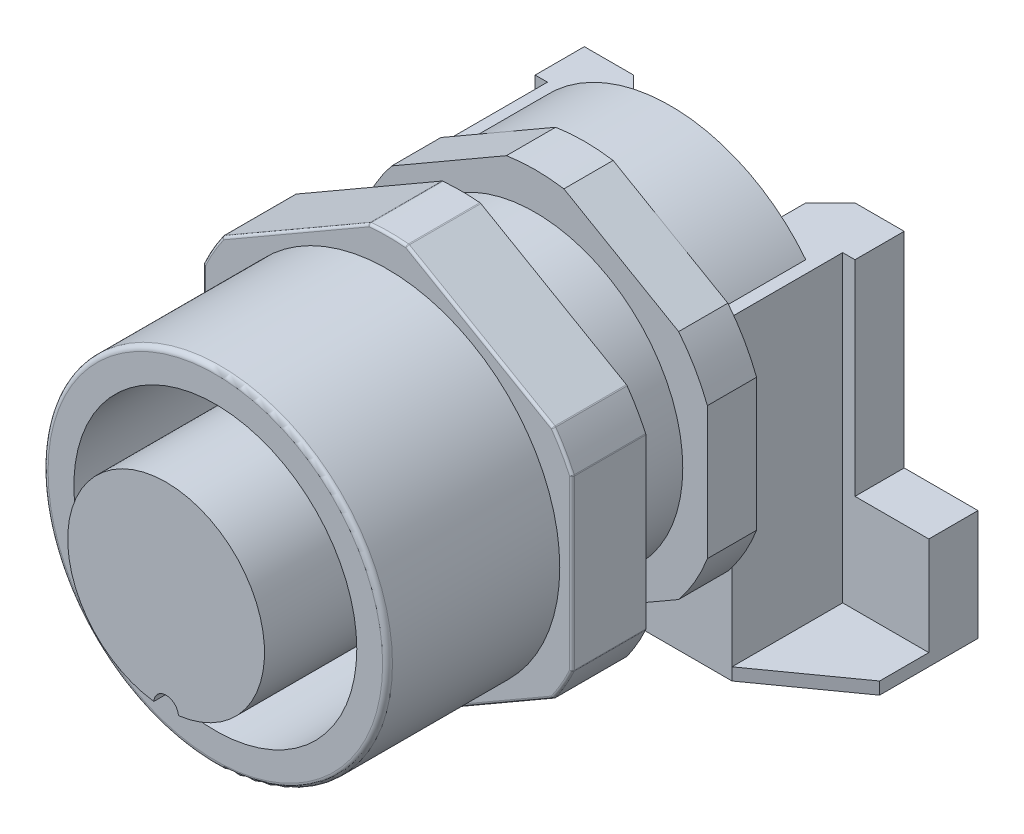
ISO-10303-21;
HEADER;
FILE_DESCRIPTION(('STEP AP214'),'2;1');
FILE_NAME('part.step','',(''),(''),'','','');
FILE_SCHEMA(('AUTOMOTIVE_DESIGN { 1 0 10303 214 1 1 1 1 }'));
ENDSEC;
DATA;
#1=APPLICATION_CONTEXT('core data for automotive mechanical design processes');
#2=APPLICATION_PROTOCOL_DEFINITION('international standard','automotive_design',2000,#1);
#3=PRODUCT_CONTEXT('',#1,'mechanical');
#4=PRODUCT('Part','Part','',(#3));
#5=PRODUCT_RELATED_PRODUCT_CATEGORY('part','',(#4));
#6=PRODUCT_DEFINITION_FORMATION('','',#4);
#7=PRODUCT_DEFINITION_CONTEXT('part definition',#1,'design');
#8=PRODUCT_DEFINITION('design','',#6,#7);
#9=PRODUCT_DEFINITION_SHAPE('','',#8);
#10=(LENGTH_UNIT() NAMED_UNIT(*) SI_UNIT(.MILLI.,.METRE.));
#11=(NAMED_UNIT(*) PLANE_ANGLE_UNIT() SI_UNIT($,.RADIAN.));
#12=(NAMED_UNIT(*) SI_UNIT($,.STERADIAN.) SOLID_ANGLE_UNIT());
#13=UNCERTAINTY_MEASURE_WITH_UNIT(LENGTH_MEASURE(1.E-05),#10,'distance_accuracy_value','');
#14=(GEOMETRIC_REPRESENTATION_CONTEXT(3) GLOBAL_UNCERTAINTY_ASSIGNED_CONTEXT((#13)) GLOBAL_UNIT_ASSIGNED_CONTEXT((#10,
#11,#12)) REPRESENTATION_CONTEXT('',''));
#15=CARTESIAN_POINT('',(0.,0.,0.));
#16=DIRECTION('',(0.,0.,1.));
#17=DIRECTION('',(1.,0.,0.));
#18=AXIS2_PLACEMENT_3D('',#15,#16,#17);
#19=CARTESIAN_POINT('',(-7.,-4.04145188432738,-5.));
#20=DIRECTION('',(0.,0.,-1.));
#21=DIRECTION('',(-1.,0.,0.));
#22=AXIS2_PLACEMENT_3D('',#19,#20,#21);
#23=PLANE('',#22);
#24=CARTESIAN_POINT('',(0.,0.,-5.));
#25=DIRECTION('',(0.,0.,-1.));
#26=DIRECTION('',(-1.,0.,0.));
#27=AXIS2_PLACEMENT_3D('',#24,#25,#26);
#28=CIRCLE('',#27,7.5);
#29=CARTESIAN_POINT('',(5.8318447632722,4.71588662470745,-5.));
#30=VERTEX_POINT('',#29);
#31=CARTESIAN_POINT('',(7.,2.69258240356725,-5.));
#32=VERTEX_POINT('',#31);
#33=EDGE_CURVE('E1103',#30,#32,#28,.T.);
#34=ORIENTED_EDGE('',*,*,#33,.T.);
#35=DIRECTION('',(0.,-1.,0.));
#36=VECTOR('',#35,1.);
#37=CARTESIAN_POINT('',(7.,4.04145188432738,-5.));
#38=LINE('',#37,#36);
#39=CARTESIAN_POINT('',(7.,-2.69258240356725,-5.));
#40=VERTEX_POINT('',#39);
#41=EDGE_CURVE('E642',#32,#40,#38,.T.);
#42=ORIENTED_EDGE('',*,*,#41,.T.);
#43=CARTESIAN_POINT('',(6.,-4.5,-5.));
#44=VERTEX_POINT('',#43);
#45=EDGE_CURVE('E1106',#40,#44,#28,.T.);
#46=ORIENTED_EDGE('',*,*,#45,.T.);
#47=DIRECTION('',(0.,-1.,0.));
#48=VECTOR('',#47,1.);
#49=CARTESIAN_POINT('',(6.,4.3301270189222,-5.));
#50=LINE('',#49,#48);
#51=CARTESIAN_POINT('',(6.,4.3301270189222,-5.));
#52=VERTEX_POINT('',#51);
#53=EDGE_CURVE('E534',#52,#44,#50,.T.);
#54=ORIENTED_EDGE('',*,*,#53,.F.);
#55=DIRECTION('',(-1.,0.,0.));
#56=VECTOR('',#55,1.);
#57=CARTESIAN_POINT('',(3.5,4.3301270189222,-5.));
#58=LINE('',#57,#56);
#59=CARTESIAN_POINT('',(5.5,4.33012701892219,-5.));
#60=VERTEX_POINT('',#59);
#61=EDGE_CURVE('E555',#52,#60,#58,.T.);
#62=ORIENTED_EDGE('',*,*,#61,.T.);
#63=CARTESIAN_POINT('',(0.,0.,-5.));
#64=DIRECTION('',(0.,0.,-1.));
#65=DIRECTION('',(-1.,0.,0.));
#66=AXIS2_PLACEMENT_3D('',#63,#64,#65);
#67=CIRCLE('',#66,7.);
#68=CARTESIAN_POINT('',(3.5,6.06217782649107,-5.));
#69=VERTEX_POINT('',#68);
#70=EDGE_CURVE('E587',#69,#60,#67,.T.);
#71=ORIENTED_EDGE('',*,*,#70,.F.);
#72=DIRECTION('',(0.866025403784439,-0.5,0.));
#73=VECTOR('',#72,1.);
#74=CARTESIAN_POINT('',(0.,8.08290376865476,-5.));
#75=LINE('',#74,#73);
#76=EDGE_CURVE('E638',#69,#30,#75,.T.);
#77=ORIENTED_EDGE('',*,*,#76,.T.);
#78=EDGE_LOOP('',(#34,#42,#46,#54,#62,#71,#77));
#79=FACE_BOUND('',#78,.T.);
#80=ADVANCED_FACE('F35',(#79),#23,.T.);
#81=CARTESIAN_POINT('',(-3.5,6.06217782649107,-5.));
#82=VERTEX_POINT('',#81);
#83=EDGE_CURVE('E588',#82,#69,#67,.T.);
#84=ORIENTED_EDGE('',*,*,#83,.F.);
#85=DIRECTION('',(0.866025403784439,0.5,0.));
#86=VECTOR('',#85,1.);
#87=CARTESIAN_POINT('',(-7.,4.04145188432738,-5.));
#88=LINE('',#87,#86);
#89=CARTESIAN_POINT('',(-1.16815523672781,7.40846902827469,-5.));
#90=VERTEX_POINT('',#89);
#91=EDGE_CURVE('E634',#82,#90,#88,.T.);
#92=ORIENTED_EDGE('',*,*,#91,.T.);
#93=CARTESIAN_POINT('',(1.16815523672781,7.4084690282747,-5.));
#94=VERTEX_POINT('',#93);
#95=EDGE_CURVE('E1105',#90,#94,#28,.T.);
#96=ORIENTED_EDGE('',*,*,#95,.T.);
#97=EDGE_CURVE('E639',#94,#69,#75,.T.);
#98=ORIENTED_EDGE('',*,*,#97,.T.);
#99=EDGE_LOOP('',(#84,#92,#96,#98));
#100=FACE_BOUND('',#99,.T.);
#101=ADVANCED_FACE('F1109',(#100),#23,.T.);
#102=CARTESIAN_POINT('',(-7.,-4.04145188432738,-3.));
#103=DIRECTION('',(0.,0.,-1.));
#104=DIRECTION('',(-1.,0.,0.));
#105=AXIS2_PLACEMENT_3D('',#102,#103,#104);
#106=PLANE('',#105);
#107=CARTESIAN_POINT('',(0.,0.,-3.));
#108=DIRECTION('',(0.,0.,-1.));
#109=DIRECTION('',(-1.,0.,0.));
#110=AXIS2_PLACEMENT_3D('',#107,#108,#109);
#111=CIRCLE('',#110,6.);
#112=CARTESIAN_POINT('',(-6.,0.,-3.));
#113=VERTEX_POINT('',#112);
#114=EDGE_CURVE('E646',#113,#113,#111,.T.);
#115=ORIENTED_EDGE('',*,*,#114,.T.);
#116=EDGE_LOOP('',(#115));
#117=FACE_BOUND('',#116,.T.);
#118=CARTESIAN_POINT('',(0.,0.,-3.));
#119=DIRECTION('',(0.,0.,-1.));
#120=DIRECTION('',(-1.,0.,0.));
#121=AXIS2_PLACEMENT_3D('',#118,#119,#120);
#122=CIRCLE('',#121,7.5);
#123=CARTESIAN_POINT('',(-7.,2.69258240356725,-3.));
#124=VERTEX_POINT('',#123);
#125=CARTESIAN_POINT('',(-5.8318447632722,4.71588662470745,-3.));
#126=VERTEX_POINT('',#125);
#127=EDGE_CURVE('E595',#124,#126,#122,.T.);
#128=ORIENTED_EDGE('',*,*,#127,.F.);
#129=DIRECTION('',(0.,1.,0.));
#130=VECTOR('',#129,1.);
#131=CARTESIAN_POINT('',(-7.,-4.04145188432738,-3.));
#132=LINE('',#131,#130);
#133=CARTESIAN_POINT('',(-7.,-2.69258240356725,-3.));
#134=VERTEX_POINT('',#133);
#135=EDGE_CURVE('E649',#134,#124,#132,.T.);
#136=ORIENTED_EDGE('',*,*,#135,.F.);
#137=CARTESIAN_POINT('',(-5.8318447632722,-4.71588662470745,-3.));
#138=VERTEX_POINT('',#137);
#139=EDGE_CURVE('E599',#138,#134,#122,.T.);
#140=ORIENTED_EDGE('',*,*,#139,.F.);
#141=DIRECTION('',(-0.866025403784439,0.5,0.));
#142=VECTOR('',#141,1.);
#143=CARTESIAN_POINT('',(0.,-8.08290376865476,-3.));
#144=LINE('',#143,#142);
#145=CARTESIAN_POINT('',(-1.16815523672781,-7.40846902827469,-3.));
#146=VERTEX_POINT('',#145);
#147=EDGE_CURVE('E628',#146,#138,#144,.T.);
#148=ORIENTED_EDGE('',*,*,#147,.F.);
#149=CARTESIAN_POINT('',(1.1681552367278,-7.4084690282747,-3.));
#150=VERTEX_POINT('',#149);
#151=EDGE_CURVE('E1070',#150,#146,#122,.T.);
#152=ORIENTED_EDGE('',*,*,#151,.F.);
#153=DIRECTION('',(-0.866025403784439,-0.5,0.));
#154=VECTOR('',#153,1.);
#155=CARTESIAN_POINT('',(7.,-4.04145188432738,-3.));
#156=LINE('',#155,#154);
#157=CARTESIAN_POINT('',(5.8318447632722,-4.71588662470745,-3.));
#158=VERTEX_POINT('',#157);
#159=EDGE_CURVE('E632',#158,#150,#156,.T.);
#160=ORIENTED_EDGE('',*,*,#159,.F.);
#161=CARTESIAN_POINT('',(7.,-2.69258240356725,-3.));
#162=VERTEX_POINT('',#161);
#163=EDGE_CURVE('E1073',#162,#158,#122,.T.);
#164=ORIENTED_EDGE('',*,*,#163,.F.);
#165=DIRECTION('',(0.,-1.,0.));
#166=VECTOR('',#165,1.);
#167=CARTESIAN_POINT('',(7.,4.04145188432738,-3.));
#168=LINE('',#167,#166);
#169=CARTESIAN_POINT('',(7.,2.69258240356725,-3.));
#170=VERTEX_POINT('',#169);
#171=EDGE_CURVE('E658',#170,#162,#168,.T.);
#172=ORIENTED_EDGE('',*,*,#171,.F.);
#173=CARTESIAN_POINT('',(5.8318447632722,4.71588662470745,-3.));
#174=VERTEX_POINT('',#173);
#175=EDGE_CURVE('E1075',#174,#170,#122,.T.);
#176=ORIENTED_EDGE('',*,*,#175,.F.);
#177=DIRECTION('',(0.866025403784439,-0.5,0.));
#178=VECTOR('',#177,1.);
#179=CARTESIAN_POINT('',(0.,8.08290376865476,-3.));
#180=LINE('',#179,#178);
#181=CARTESIAN_POINT('',(1.16815523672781,7.40846902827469,-3.));
#182=VERTEX_POINT('',#181);
#183=EDGE_CURVE('E655',#182,#174,#180,.T.);
#184=ORIENTED_EDGE('',*,*,#183,.F.);
#185=CARTESIAN_POINT('',(-1.1681552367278,7.4084690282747,-3.));
#186=VERTEX_POINT('',#185);
#187=EDGE_CURVE('E598',#186,#182,#122,.T.);
#188=ORIENTED_EDGE('',*,*,#187,.F.);
#189=DIRECTION('',(0.866025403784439,0.5,0.));
#190=VECTOR('',#189,1.);
#191=CARTESIAN_POINT('',(-7.,4.04145188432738,-3.));
#192=LINE('',#191,#190);
#193=EDGE_CURVE('E652',#126,#186,#192,.T.);
#194=ORIENTED_EDGE('',*,*,#193,.F.);
#195=EDGE_LOOP('',(#128,#136,#140,#148,#152,#160,#164,#172,#176,#184,#188,#194));
#196=FACE_BOUND('',#195,.T.);
#197=ADVANCED_FACE('F1068',(#117,#196),#106,.F.);
#198=CARTESIAN_POINT('',(0.,-8.08290376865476,-5.));
#199=DIRECTION('',(0.5,0.866025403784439,0.));
#200=DIRECTION('',(-0.866025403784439,0.5,0.));
#201=AXIS2_PLACEMENT_3D('',#198,#199,#200);
#202=PLANE('',#201);
#203=DIRECTION('',(0.,0.,-1.));
#204=VECTOR('',#203,1.);
#205=CARTESIAN_POINT('',(-1.16815523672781,-7.40846902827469,-3.));
#206=LINE('',#205,#204);
#207=CARTESIAN_POINT('',(-1.16815523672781,-7.40846902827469,-5.));
#208=VERTEX_POINT('',#207);
#209=EDGE_CURVE('E626',#146,#208,#206,.T.);
#210=ORIENTED_EDGE('',*,*,#209,.F.);
#211=ORIENTED_EDGE('',*,*,#147,.T.);
#212=DIRECTION('',(0.,0.,-1.));
#213=VECTOR('',#212,1.);
#214=CARTESIAN_POINT('',(-5.8318447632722,-4.71588662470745,-3.));
#215=LINE('',#214,#213);
#216=CARTESIAN_POINT('',(-5.8318447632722,-4.71588662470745,-5.));
#217=VERTEX_POINT('',#216);
#218=EDGE_CURVE('E624',#217,#138,#215,.F.);
#219=ORIENTED_EDGE('',*,*,#218,.F.);
#220=DIRECTION('',(-0.866025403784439,0.5,0.));
#221=VECTOR('',#220,1.);
#222=CARTESIAN_POINT('',(0.,-8.08290376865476,-5.));
#223=LINE('',#222,#221);
#224=EDGE_CURVE('E629',#208,#217,#223,.T.);
#225=ORIENTED_EDGE('',*,*,#224,.F.);
#226=EDGE_LOOP('',(#210,#211,#219,#225));
#227=FACE_BOUND('',#226,.T.);
#228=ADVANCED_FACE('F1063',(#227),#202,.F.);
#229=CARTESIAN_POINT('',(-7.,-4.04145188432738,-5.));
#230=DIRECTION('',(1.,0.,0.));
#231=DIRECTION('',(0.,1.,0.));
#232=AXIS2_PLACEMENT_3D('',#229,#230,#231);
#233=PLANE('',#232);
#234=DIRECTION('',(0.,0.,-1.));
#235=VECTOR('',#234,1.);
#236=CARTESIAN_POINT('',(-7.,-2.69258240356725,-3.));
#237=LINE('',#236,#235);
#238=CARTESIAN_POINT('',(-7.,-2.69258240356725,-5.));
#239=VERTEX_POINT('',#238);
#240=EDGE_CURVE('E621',#134,#239,#237,.T.);
#241=ORIENTED_EDGE('',*,*,#240,.F.);
#242=ORIENTED_EDGE('',*,*,#135,.T.);
#243=DIRECTION('',(0.,0.,-1.));
#244=VECTOR('',#243,1.);
#245=CARTESIAN_POINT('',(-7.,2.69258240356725,-3.));
#246=LINE('',#245,#244);
#247=CARTESIAN_POINT('',(-7.,2.69258240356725,-5.));
#248=VERTEX_POINT('',#247);
#249=EDGE_CURVE('E619',#248,#124,#246,.F.);
#250=ORIENTED_EDGE('',*,*,#249,.F.);
#251=DIRECTION('',(0.,1.,0.));
#252=VECTOR('',#251,1.);
#253=CARTESIAN_POINT('',(-7.,-4.04145188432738,-5.));
#254=LINE('',#253,#252);
#255=EDGE_CURVE('E631',#239,#248,#254,.T.);
#256=ORIENTED_EDGE('',*,*,#255,.F.);
#257=EDGE_LOOP('',(#241,#242,#250,#256));
#258=FACE_BOUND('',#257,.T.);
#259=ADVANCED_FACE('F1158',(#258),#233,.F.);
#260=CARTESIAN_POINT('',(-7.,4.04145188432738,-5.));
#261=DIRECTION('',(0.5,-0.866025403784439,0.));
#262=DIRECTION('',(0.866025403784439,0.5,0.));
#263=AXIS2_PLACEMENT_3D('',#260,#261,#262);
#264=PLANE('',#263);
#265=DIRECTION('',(0.,0.,-1.));
#266=VECTOR('',#265,1.);
#267=CARTESIAN_POINT('',(-5.8318447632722,4.71588662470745,-3.));
#268=LINE('',#267,#266);
#269=CARTESIAN_POINT('',(-5.8318447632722,4.71588662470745,-5.));
#270=VERTEX_POINT('',#269);
#271=EDGE_CURVE('E616',#126,#270,#268,.T.);
#272=ORIENTED_EDGE('',*,*,#271,.F.);
#273=ORIENTED_EDGE('',*,*,#193,.T.);
#274=DIRECTION('',(0.,0.,-1.));
#275=VECTOR('',#274,1.);
#276=CARTESIAN_POINT('',(-1.1681552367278,7.4084690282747,-3.));
#277=LINE('',#276,#275);
#278=EDGE_CURVE('E614',#90,#186,#277,.F.);
#279=ORIENTED_EDGE('',*,*,#278,.F.);
#280=ORIENTED_EDGE('',*,*,#91,.F.);
#281=EDGE_CURVE('E635',#270,#82,#88,.T.);
#282=ORIENTED_EDGE('',*,*,#281,.F.);
#283=EDGE_LOOP('',(#272,#273,#279,#280,#282));
#284=FACE_BOUND('',#283,.T.);
#285=ADVANCED_FACE('F1154',(#284),#264,.F.);
#286=CARTESIAN_POINT('',(0.,8.08290376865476,-5.));
#287=DIRECTION('',(-0.5,-0.866025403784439,0.));
#288=DIRECTION('',(0.866025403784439,-0.5,0.));
#289=AXIS2_PLACEMENT_3D('',#286,#287,#288);
#290=PLANE('',#289);
#291=DIRECTION('',(0.,0.,-1.));
#292=VECTOR('',#291,1.);
#293=CARTESIAN_POINT('',(1.16815523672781,7.40846902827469,-3.));
#294=LINE('',#293,#292);
#295=EDGE_CURVE('E612',#182,#94,#294,.T.);
#296=ORIENTED_EDGE('',*,*,#295,.F.);
#297=ORIENTED_EDGE('',*,*,#183,.T.);
#298=DIRECTION('',(0.,0.,-1.));
#299=VECTOR('',#298,1.);
#300=CARTESIAN_POINT('',(5.8318447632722,4.71588662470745,-3.));
#301=LINE('',#300,#299);
#302=EDGE_CURVE('E610',#30,#174,#301,.F.);
#303=ORIENTED_EDGE('',*,*,#302,.F.);
#304=ORIENTED_EDGE('',*,*,#76,.F.);
#305=ORIENTED_EDGE('',*,*,#97,.F.);
#306=EDGE_LOOP('',(#296,#297,#303,#304,#305));
#307=FACE_BOUND('',#306,.T.);
#308=ADVANCED_FACE('F1093',(#307),#290,.F.);
#309=CARTESIAN_POINT('',(7.,4.04145188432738,-5.));
#310=DIRECTION('',(-1.,0.,0.));
#311=DIRECTION('',(0.,-1.,0.));
#312=AXIS2_PLACEMENT_3D('',#309,#310,#311);
#313=PLANE('',#312);
#314=DIRECTION('',(0.,0.,-1.));
#315=VECTOR('',#314,1.);
#316=CARTESIAN_POINT('',(7.,2.69258240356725,-3.));
#317=LINE('',#316,#315);
#318=EDGE_CURVE('E607',#170,#32,#317,.T.);
#319=ORIENTED_EDGE('',*,*,#318,.F.);
#320=ORIENTED_EDGE('',*,*,#171,.T.);
#321=DIRECTION('',(0.,0.,-1.));
#322=VECTOR('',#321,1.);
#323=CARTESIAN_POINT('',(7.,-2.69258240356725,-3.));
#324=LINE('',#323,#322);
#325=EDGE_CURVE('E605',#40,#162,#324,.F.);
#326=ORIENTED_EDGE('',*,*,#325,.F.);
#327=ORIENTED_EDGE('',*,*,#41,.F.);
#328=EDGE_LOOP('',(#319,#320,#326,#327));
#329=FACE_BOUND('',#328,.T.);
#330=ADVANCED_FACE('F1099',(#329),#313,.F.);
#331=CARTESIAN_POINT('',(7.,-4.04145188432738,-5.));
#332=DIRECTION('',(-0.5,0.866025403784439,0.));
#333=DIRECTION('',(-0.866025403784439,-0.5,0.));
#334=AXIS2_PLACEMENT_3D('',#331,#332,#333);
#335=PLANE('',#334);
#336=DIRECTION('',(0.,0.,-1.));
#337=VECTOR('',#336,1.);
#338=CARTESIAN_POINT('',(5.8318447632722,-4.71588662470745,-3.));
#339=LINE('',#338,#337);
#340=CARTESIAN_POINT('',(5.8318447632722,-4.71588662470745,-5.));
#341=VERTEX_POINT('',#340);
#342=EDGE_CURVE('E602',#158,#341,#339,.T.);
#343=ORIENTED_EDGE('',*,*,#342,.F.);
#344=ORIENTED_EDGE('',*,*,#159,.T.);
#345=DIRECTION('',(0.,0.,-1.));
#346=VECTOR('',#345,1.);
#347=CARTESIAN_POINT('',(1.1681552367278,-7.4084690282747,-3.));
#348=LINE('',#347,#346);
#349=CARTESIAN_POINT('',(1.1681552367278,-7.4084690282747,-5.));
#350=VERTEX_POINT('',#349);
#351=EDGE_CURVE('E597',#350,#150,#348,.F.);
#352=ORIENTED_EDGE('',*,*,#351,.F.);
#353=DIRECTION('',(-0.866025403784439,-0.5,0.));
#354=VECTOR('',#353,1.);
#355=CARTESIAN_POINT('',(7.,-4.04145188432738,-5.));
#356=LINE('',#355,#354);
#357=EDGE_CURVE('E644',#341,#350,#356,.T.);
#358=ORIENTED_EDGE('',*,*,#357,.F.);
#359=EDGE_LOOP('',(#343,#344,#352,#358));
#360=FACE_BOUND('',#359,.T.);
#361=ADVANCED_FACE('F1122',(#360),#335,.F.);
#362=DIRECTION('',(-1.,0.,0.));
#363=VECTOR('',#362,1.);
#364=CARTESIAN_POINT('',(-3.5,4.3301270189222,-5.));
#365=LINE('',#364,#363);
#366=CARTESIAN_POINT('',(-5.5,4.33012701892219,-5.));
#367=VERTEX_POINT('',#366);
#368=CARTESIAN_POINT('',(-6.,4.3301270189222,-5.));
#369=VERTEX_POINT('',#368);
#370=EDGE_CURVE('E570',#367,#369,#365,.T.);
#371=ORIENTED_EDGE('',*,*,#370,.T.);
#372=DIRECTION('',(0.,1.,0.));
#373=VECTOR('',#372,1.);
#374=CARTESIAN_POINT('',(-6.,4.3301270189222,-5.));
#375=LINE('',#374,#373);
#376=CARTESIAN_POINT('',(-6.,-4.5,-5.));
#377=VERTEX_POINT('',#376);
#378=EDGE_CURVE('E518',#377,#369,#375,.T.);
#379=ORIENTED_EDGE('',*,*,#378,.F.);
#380=CARTESIAN_POINT('',(0.,0.,-5.));
#381=DIRECTION('',(0.,0.,1.));
#382=DIRECTION('',(1.,0.,0.));
#383=AXIS2_PLACEMENT_3D('',#380,#381,#382);
#384=CIRCLE('',#383,7.5);
#385=EDGE_CURVE('E529',#377,#239,#384,.F.);
#386=ORIENTED_EDGE('',*,*,#385,.T.);
#387=ORIENTED_EDGE('',*,*,#255,.T.);
#388=CARTESIAN_POINT('',(0.,0.,-5.));
#389=DIRECTION('',(0.,0.,-1.));
#390=DIRECTION('',(-1.,0.,0.));
#391=AXIS2_PLACEMENT_3D('',#388,#389,#390);
#392=CIRCLE('',#391,7.5);
#393=EDGE_CURVE('E594',#248,#270,#392,.T.);
#394=ORIENTED_EDGE('',*,*,#393,.T.);
#395=ORIENTED_EDGE('',*,*,#281,.T.);
#396=EDGE_CURVE('E581',#367,#82,#67,.T.);
#397=ORIENTED_EDGE('',*,*,#396,.F.);
#398=EDGE_LOOP('',(#371,#379,#386,#387,#394,#395,#397));
#399=FACE_BOUND('',#398,.T.);
#400=ADVANCED_FACE('F1149',(#399),#23,.T.);
#401=CARTESIAN_POINT('',(7.49999999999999,4.33012701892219,0.));
#402=DIRECTION('',(0.,0.,1.));
#403=DIRECTION('',(1.,0.,0.));
#404=AXIS2_PLACEMENT_3D('',#401,#402,#403);
#405=PLANE('',#404);
#406=CARTESIAN_POINT('',(0.,0.,0.));
#407=DIRECTION('',(0.,0.,1.));
#408=DIRECTION('',(1.,0.,0.));
#409=AXIS2_PLACEMENT_3D('',#406,#407,#408);
#410=CIRCLE('',#409,8.25);
#411=CARTESIAN_POINT('',(7.49079754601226,3.45694259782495,0.));
#412=VERTEX_POINT('',#411);
#413=CARTESIAN_POINT('',(6.7391988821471,4.75874967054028,0.));
#414=VERTEX_POINT('',#413);
#415=EDGE_CURVE('E694',#412,#414,#410,.T.);
#416=ORIENTED_EDGE('',*,*,#415,.F.);
#417=CARTESIAN_POINT('',(7.39999999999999,3.41504026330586,0.));
#418=DIRECTION('',(0.,0.,1.));
#419=DIRECTION('',(1.,0.,0.));
#420=AXIS2_PLACEMENT_3D('',#417,#418,#419);
#421=CIRCLE('',#420,0.1);
#422=CARTESIAN_POINT('',(7.49999999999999,3.41504026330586,0.));
#423=VERTEX_POINT('',#422);
#424=EDGE_CURVE('E779',#412,#423,#421,.F.);
#425=ORIENTED_EDGE('',*,*,#424,.T.);
#426=DIRECTION('',(0.,1.,0.));
#427=VECTOR('',#426,1.);
#428=CARTESIAN_POINT('',(7.49999999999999,-4.33012701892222,0.));
#429=LINE('',#428,#427);
#430=CARTESIAN_POINT('',(7.49999999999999,-3.41504026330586,0.));
#431=VERTEX_POINT('',#430);
#432=EDGE_CURVE('E696',#431,#423,#429,.T.);
#433=ORIENTED_EDGE('',*,*,#432,.F.);
#434=CARTESIAN_POINT('',(7.39999999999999,-3.41504026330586,0.));
#435=DIRECTION('',(0.,0.,1.));
#436=DIRECTION('',(1.,0.,0.));
#437=AXIS2_PLACEMENT_3D('',#434,#435,#436);
#438=CIRCLE('',#437,0.1);
#439=CARTESIAN_POINT('',(7.49079754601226,-3.45694259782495,0.));
#440=VERTEX_POINT('',#439);
#441=EDGE_CURVE('E761',#431,#440,#438,.F.);
#442=ORIENTED_EDGE('',*,*,#441,.T.);
#443=CARTESIAN_POINT('',(6.73919888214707,-4.75874967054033,0.));
#444=VERTEX_POINT('',#443);
#445=EDGE_CURVE('E890',#444,#440,#410,.T.);
#446=ORIENTED_EDGE('',*,*,#445,.F.);
#447=CARTESIAN_POINT('',(6.65751162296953,-4.70106785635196,0.));
#448=DIRECTION('',(0.,0.,1.));
#449=DIRECTION('',(1.,0.,0.));
#450=AXIS2_PLACEMENT_3D('',#447,#448,#449);
#451=CIRCLE('',#450,0.1);
#452=CARTESIAN_POINT('',(6.70751162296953,-4.78767039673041,0.));
#453=VERTEX_POINT('',#452);
#454=EDGE_CURVE('E763',#444,#453,#451,.F.);
#455=ORIENTED_EDGE('',*,*,#454,.T.);
#456=DIRECTION('',(0.866025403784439,0.5,0.));
#457=VECTOR('',#456,1.);
#458=CARTESIAN_POINT('',(0.,-8.6602540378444,0.));
#459=LINE('',#458,#457);
#460=CARTESIAN_POINT('',(0.792488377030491,-8.2027106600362,0.));
#461=VERTEX_POINT('',#460);
#462=EDGE_CURVE('E711',#461,#453,#459,.T.);
#463=ORIENTED_EDGE('',*,*,#462,.F.);
#464=CARTESIAN_POINT('',(0.742488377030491,-8.11610811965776,0.));
#465=DIRECTION('',(0.,0.,1.));
#466=DIRECTION('',(1.,0.,0.));
#467=AXIS2_PLACEMENT_3D('',#464,#465,#466);
#468=CIRCLE('',#467,0.1);
#469=CARTESIAN_POINT('',(0.751598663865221,-8.21569226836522,0.));
#470=VERTEX_POINT('',#469);
#471=EDGE_CURVE('E757',#461,#470,#468,.F.);
#472=ORIENTED_EDGE('',*,*,#471,.T.);
#473=CARTESIAN_POINT('',(-0.751598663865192,-8.21569226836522,0.));
#474=VERTEX_POINT('',#473);
#475=EDGE_CURVE('E2134',#474,#470,#410,.T.);
#476=ORIENTED_EDGE('',*,*,#475,.F.);
#477=CARTESIAN_POINT('',(-0.742488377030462,-8.11610811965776,0.));
#478=DIRECTION('',(0.,0.,1.));
#479=DIRECTION('',(1.,0.,0.));
#480=AXIS2_PLACEMENT_3D('',#477,#478,#479);
#481=CIRCLE('',#480,0.1);
#482=CARTESIAN_POINT('',(-0.792488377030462,-8.2027106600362,0.));
#483=VERTEX_POINT('',#482);
#484=EDGE_CURVE('E759',#474,#483,#481,.F.);
#485=ORIENTED_EDGE('',*,*,#484,.T.);
#486=DIRECTION('',(0.866025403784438,-0.5,0.));
#487=VECTOR('',#486,1.);
#488=CARTESIAN_POINT('',(-7.5,-4.3301270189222,0.));
#489=LINE('',#488,#487);
#490=CARTESIAN_POINT('',(-6.70751162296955,-4.78767039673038,0.));
#491=VERTEX_POINT('',#490);
#492=EDGE_CURVE('E708',#491,#483,#489,.T.);
#493=ORIENTED_EDGE('',*,*,#492,.F.);
#494=CARTESIAN_POINT('',(-6.65751162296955,-4.70106785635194,0.));
#495=DIRECTION('',(0.,0.,1.));
#496=DIRECTION('',(1.,0.,0.));
#497=AXIS2_PLACEMENT_3D('',#494,#495,#496);
#498=CIRCLE('',#497,0.1);
#499=CARTESIAN_POINT('',(-6.73919888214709,-4.7587496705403,0.));
#500=VERTEX_POINT('',#499);
#501=EDGE_CURVE('E765',#491,#500,#498,.F.);
#502=ORIENTED_EDGE('',*,*,#501,.T.);
#503=CARTESIAN_POINT('',(-7.49079754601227,-3.45694259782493,0.));
#504=VERTEX_POINT('',#503);
#505=EDGE_CURVE('E2135',#504,#500,#410,.T.);
#506=ORIENTED_EDGE('',*,*,#505,.F.);
#507=CARTESIAN_POINT('',(-7.4,-3.41504026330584,0.));
#508=DIRECTION('',(0.,0.,1.));
#509=DIRECTION('',(1.,0.,0.));
#510=AXIS2_PLACEMENT_3D('',#507,#508,#509);
#511=CIRCLE('',#510,0.1);
#512=CARTESIAN_POINT('',(-7.5,-3.41504026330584,0.));
#513=VERTEX_POINT('',#512);
#514=EDGE_CURVE('E767',#504,#513,#511,.F.);
#515=ORIENTED_EDGE('',*,*,#514,.T.);
#516=DIRECTION('',(0.,-1.,0.));
#517=VECTOR('',#516,1.);
#518=CARTESIAN_POINT('',(-7.5,4.33012701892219,0.));
#519=LINE('',#518,#517);
#520=CARTESIAN_POINT('',(-7.5,3.41504026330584,0.));
#521=VERTEX_POINT('',#520);
#522=EDGE_CURVE('E705',#521,#513,#519,.T.);
#523=ORIENTED_EDGE('',*,*,#522,.F.);
#524=CARTESIAN_POINT('',(-7.4,3.41504026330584,0.));
#525=DIRECTION('',(0.,0.,1.));
#526=DIRECTION('',(1.,0.,0.));
#527=AXIS2_PLACEMENT_3D('',#524,#525,#526);
#528=CIRCLE('',#527,0.1);
#529=CARTESIAN_POINT('',(-7.49079754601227,3.45694259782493,0.));
#530=VERTEX_POINT('',#529);
#531=EDGE_CURVE('E769',#521,#530,#528,.F.);
#532=ORIENTED_EDGE('',*,*,#531,.T.);
#533=CARTESIAN_POINT('',(-6.7391988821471,4.75874967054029,0.));
#534=VERTEX_POINT('',#533);
#535=EDGE_CURVE('E695',#534,#530,#410,.T.);
#536=ORIENTED_EDGE('',*,*,#535,.F.);
#537=CARTESIAN_POINT('',(-6.65751162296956,4.70106785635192,0.));
#538=DIRECTION('',(0.,0.,1.));
#539=DIRECTION('',(1.,0.,0.));
#540=AXIS2_PLACEMENT_3D('',#537,#538,#539);
#541=CIRCLE('',#540,0.1);
#542=CARTESIAN_POINT('',(-6.70751162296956,4.78767039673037,0.));
#543=VERTEX_POINT('',#542);
#544=EDGE_CURVE('E771',#534,#543,#541,.F.);
#545=ORIENTED_EDGE('',*,*,#544,.T.);
#546=DIRECTION('',(-0.866025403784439,-0.5,0.));
#547=VECTOR('',#546,1.);
#548=CARTESIAN_POINT('',(0.,8.66025403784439,0.));
#549=LINE('',#548,#547);
#550=CARTESIAN_POINT('',(-0.792488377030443,8.20271066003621,0.));
#551=VERTEX_POINT('',#550);
#552=EDGE_CURVE('E702',#551,#543,#549,.T.);
#553=ORIENTED_EDGE('',*,*,#552,.F.);
#554=CARTESIAN_POINT('',(-0.742488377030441,8.11610811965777,0.));
#555=DIRECTION('',(0.,0.,1.));
#556=DIRECTION('',(1.,0.,0.));
#557=AXIS2_PLACEMENT_3D('',#554,#555,#556);
#558=CIRCLE('',#557,0.1);
#559=CARTESIAN_POINT('',(-0.751598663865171,8.21569226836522,0.));
#560=VERTEX_POINT('',#559);
#561=EDGE_CURVE('E773',#551,#560,#558,.F.);
#562=ORIENTED_EDGE('',*,*,#561,.T.);
#563=CARTESIAN_POINT('',(0.751598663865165,8.21569226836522,0.));
#564=VERTEX_POINT('',#563);
#565=EDGE_CURVE('E691',#564,#560,#410,.T.);
#566=ORIENTED_EDGE('',*,*,#565,.F.);
#567=CARTESIAN_POINT('',(0.742488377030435,8.11610811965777,0.));
#568=DIRECTION('',(0.,0.,1.));
#569=DIRECTION('',(1.,0.,0.));
#570=AXIS2_PLACEMENT_3D('',#567,#568,#569);
#571=CIRCLE('',#570,0.1);
#572=CARTESIAN_POINT('',(0.792488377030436,8.20271066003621,0.));
#573=VERTEX_POINT('',#572);
#574=EDGE_CURVE('E775',#564,#573,#571,.F.);
#575=ORIENTED_EDGE('',*,*,#574,.T.);
#576=DIRECTION('',(-0.866025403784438,0.5,0.));
#577=VECTOR('',#576,1.);
#578=CARTESIAN_POINT('',(7.49999999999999,4.33012701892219,0.));
#579=LINE('',#578,#577);
#580=CARTESIAN_POINT('',(6.70751162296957,4.78767039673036,0.));
#581=VERTEX_POINT('',#580);
#582=EDGE_CURVE('E699',#581,#573,#579,.T.);
#583=ORIENTED_EDGE('',*,*,#582,.F.);
#584=CARTESIAN_POINT('',(6.65751162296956,4.70106785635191,0.));
#585=DIRECTION('',(0.,0.,1.));
#586=DIRECTION('',(1.,0.,0.));
#587=AXIS2_PLACEMENT_3D('',#584,#585,#586);
#588=CIRCLE('',#587,0.1);
#589=EDGE_CURVE('E777',#581,#414,#588,.F.);
#590=ORIENTED_EDGE('',*,*,#589,.T.);
#591=EDGE_LOOP('',(#416,#425,#433,#442,#446,#455,#463,#472,#476,#485,#493,#502,#506,#515,#523,
#532,#536,#545,#553,#562,#566,#575,#583,#590));
#592=FACE_BOUND('',#591,.T.);
#593=CARTESIAN_POINT('',(0.,0.,0.));
#594=DIRECTION('',(0.,0.,1.));
#595=DIRECTION('',(1.,0.,0.));
#596=AXIS2_PLACEMENT_3D('',#593,#594,#595);
#597=CIRCLE('',#596,6.);
#598=CARTESIAN_POINT('',(6.,0.,0.));
#599=VERTEX_POINT('',#598);
#600=EDGE_CURVE('E954',#599,#599,#597,.F.);
#601=ORIENTED_EDGE('',*,*,#600,.F.);
#602=EDGE_LOOP('',(#601));
#603=FACE_BOUND('',#602,.T.);
#604=ADVANCED_FACE('F1178',(#592,#603),#405,.F.);
#605=CARTESIAN_POINT('',(7.49999999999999,4.33012701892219,3.));
#606=DIRECTION('',(0.,0.,1.));
#607=DIRECTION('',(1.,0.,0.));
#608=AXIS2_PLACEMENT_3D('',#605,#606,#607);
#609=PLANE('',#608);
#610=DIRECTION('',(0.,1.,0.));
#611=VECTOR('',#610,1.);
#612=CARTESIAN_POINT('',(7.39999999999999,4.33012701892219,3.));
#613=LINE('',#612,#611);
#614=CARTESIAN_POINT('',(7.39999999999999,-3.41504026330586,3.));
#615=VERTEX_POINT('',#614);
#616=CARTESIAN_POINT('',(7.39999999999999,3.41504026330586,3.));
#617=VERTEX_POINT('',#616);
#618=EDGE_CURVE('E714',#615,#617,#613,.T.);
#619=ORIENTED_EDGE('',*,*,#618,.T.);
#620=CARTESIAN_POINT('',(0.,0.,3.));
#621=DIRECTION('',(0.,0.,1.));
#622=DIRECTION('',(1.,0.,0.));
#623=AXIS2_PLACEMENT_3D('',#620,#621,#622);
#624=CIRCLE('',#623,8.15);
#625=CARTESIAN_POINT('',(6.65751162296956,4.70106785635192,3.));
#626=VERTEX_POINT('',#625);
#627=EDGE_CURVE('E874',#617,#626,#624,.T.);
#628=ORIENTED_EDGE('',*,*,#627,.T.);
#629=DIRECTION('',(-0.866025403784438,0.5,0.));
#630=VECTOR('',#629,1.);
#631=CARTESIAN_POINT('',(-0.0500000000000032,8.57365149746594,3.));
#632=LINE('',#631,#630);
#633=CARTESIAN_POINT('',(0.742488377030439,8.11610811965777,3.));
#634=VERTEX_POINT('',#633);
#635=EDGE_CURVE('E717',#626,#634,#632,.T.);
#636=ORIENTED_EDGE('',*,*,#635,.T.);
#637=CARTESIAN_POINT('',(0.,0.,3.));
#638=DIRECTION('',(0.,0.,1.));
#639=DIRECTION('',(1.,0.,0.));
#640=AXIS2_PLACEMENT_3D('',#637,#638,#639);
#641=CIRCLE('',#640,8.15);
#642=CARTESIAN_POINT('',(-0.742488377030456,8.11610811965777,3.));
#643=VERTEX_POINT('',#642);
#644=EDGE_CURVE('E872',#634,#643,#641,.T.);
#645=ORIENTED_EDGE('',*,*,#644,.T.);
#646=DIRECTION('',(-0.866025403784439,-0.5,0.));
#647=VECTOR('',#646,1.);
#648=CARTESIAN_POINT('',(-7.45,4.24352447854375,3.));
#649=LINE('',#648,#647);
#650=CARTESIAN_POINT('',(-6.65751162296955,4.70106785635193,3.));
#651=VERTEX_POINT('',#650);
#652=EDGE_CURVE('E720',#643,#651,#649,.T.);
#653=ORIENTED_EDGE('',*,*,#652,.T.);
#654=CARTESIAN_POINT('',(0.,0.,3.));
#655=DIRECTION('',(0.,0.,1.));
#656=DIRECTION('',(1.,0.,0.));
#657=AXIS2_PLACEMENT_3D('',#654,#655,#656);
#658=CIRCLE('',#657,8.15);
#659=CARTESIAN_POINT('',(-7.4,3.41504026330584,3.));
#660=VERTEX_POINT('',#659);
#661=EDGE_CURVE('E870',#651,#660,#658,.T.);
#662=ORIENTED_EDGE('',*,*,#661,.T.);
#663=DIRECTION('',(0.,-1.,0.));
#664=VECTOR('',#663,1.);
#665=CARTESIAN_POINT('',(-7.4,-4.3301270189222,3.));
#666=LINE('',#665,#664);
#667=CARTESIAN_POINT('',(-7.4,-3.41504026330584,3.));
#668=VERTEX_POINT('',#667);
#669=EDGE_CURVE('E723',#660,#668,#666,.T.);
#670=ORIENTED_EDGE('',*,*,#669,.T.);
#671=CARTESIAN_POINT('',(0.,0.,3.));
#672=DIRECTION('',(0.,0.,1.));
#673=DIRECTION('',(1.,0.,0.));
#674=AXIS2_PLACEMENT_3D('',#671,#672,#673);
#675=CIRCLE('',#674,8.15);
#676=CARTESIAN_POINT('',(-6.65751162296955,-4.70106785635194,3.));
#677=VERTEX_POINT('',#676);
#678=EDGE_CURVE('E868',#668,#677,#675,.T.);
#679=ORIENTED_EDGE('',*,*,#678,.T.);
#680=DIRECTION('',(0.866025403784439,-0.5,0.));
#681=VECTOR('',#680,1.);
#682=CARTESIAN_POINT('',(0.0500000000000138,-8.57365149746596,3.));
#683=LINE('',#682,#681);
#684=CARTESIAN_POINT('',(-0.74248837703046,-8.11610811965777,3.));
#685=VERTEX_POINT('',#684);
#686=EDGE_CURVE('E726',#677,#685,#683,.T.);
#687=ORIENTED_EDGE('',*,*,#686,.T.);
#688=CARTESIAN_POINT('',(0.,0.,3.));
#689=DIRECTION('',(0.,0.,1.));
#690=DIRECTION('',(1.,0.,0.));
#691=AXIS2_PLACEMENT_3D('',#688,#689,#690);
#692=CIRCLE('',#691,8.15);
#693=CARTESIAN_POINT('',(0.742488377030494,-8.11610811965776,3.));
#694=VERTEX_POINT('',#693);
#695=EDGE_CURVE('E864',#685,#694,#692,.T.);
#696=ORIENTED_EDGE('',*,*,#695,.T.);
#697=DIRECTION('',(0.866025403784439,0.5,0.));
#698=VECTOR('',#697,1.);
#699=CARTESIAN_POINT('',(7.44999999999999,-4.24352447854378,3.));
#700=LINE('',#699,#698);
#701=CARTESIAN_POINT('',(6.65751162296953,-4.70106785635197,3.));
#702=VERTEX_POINT('',#701);
#703=EDGE_CURVE('E729',#694,#702,#700,.T.);
#704=ORIENTED_EDGE('',*,*,#703,.T.);
#705=CARTESIAN_POINT('',(0.,0.,3.));
#706=DIRECTION('',(0.,0.,1.));
#707=DIRECTION('',(1.,0.,0.));
#708=AXIS2_PLACEMENT_3D('',#705,#706,#707);
#709=CIRCLE('',#708,8.15);
#710=EDGE_CURVE('E866',#702,#615,#709,.T.);
#711=ORIENTED_EDGE('',*,*,#710,.T.);
#712=EDGE_LOOP('',(#619,#628,#636,#645,#653,#662,#670,#679,#687,#696,#704,#711));
#713=FACE_BOUND('',#712,.T.);
#714=CARTESIAN_POINT('',(0.,0.,3.));
#715=DIRECTION('',(0.,0.,1.));
#716=DIRECTION('',(1.,0.,0.));
#717=AXIS2_PLACEMENT_3D('',#714,#715,#716);
#718=CIRCLE('',#717,7.);
#719=CARTESIAN_POINT('',(7.,0.,3.));
#720=VERTEX_POINT('',#719);
#721=EDGE_CURVE('E685',#720,#720,#718,.T.);
#722=ORIENTED_EDGE('',*,*,#721,.F.);
#723=EDGE_LOOP('',(#722));
#724=FACE_BOUND('',#723,.T.);
#725=ADVANCED_FACE('F1183',(#713,#724),#609,.T.);
#726=CARTESIAN_POINT('',(7.49999999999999,-4.33012701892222,3.));
#727=DIRECTION('',(-1.,0.,0.));
#728=DIRECTION('',(0.,0.,1.));
#729=AXIS2_PLACEMENT_3D('',#726,#727,#728);
#730=PLANE('',#729);
#731=ORIENTED_EDGE('',*,*,#432,.T.);
#732=DIRECTION('',(0.,0.,-1.));
#733=VECTOR('',#732,1.);
#734=CARTESIAN_POINT('',(7.49999999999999,3.41504026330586,2.9));
#735=LINE('',#734,#733);
#736=CARTESIAN_POINT('',(7.49999999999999,3.41504026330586,2.9));
#737=VERTEX_POINT('',#736);
#738=EDGE_CURVE('E783',#423,#737,#735,.F.);
#739=ORIENTED_EDGE('',*,*,#738,.T.);
#740=DIRECTION('',(0.,1.,0.));
#741=VECTOR('',#740,1.);
#742=CARTESIAN_POINT('',(7.49999999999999,-4.33012701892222,2.9));
#743=LINE('',#742,#741);
#744=CARTESIAN_POINT('',(7.49999999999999,-3.41504026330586,2.9));
#745=VERTEX_POINT('',#744);
#746=EDGE_CURVE('E747',#737,#745,#743,.F.);
#747=ORIENTED_EDGE('',*,*,#746,.T.);
#748=DIRECTION('',(0.,0.,-1.));
#749=VECTOR('',#748,1.);
#750=CARTESIAN_POINT('',(7.49999999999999,-3.41504026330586,0.));
#751=LINE('',#750,#749);
#752=EDGE_CURVE('E781',#745,#431,#751,.T.);
#753=ORIENTED_EDGE('',*,*,#752,.T.);
#754=EDGE_LOOP('',(#731,#739,#747,#753));
#755=FACE_BOUND('',#754,.T.);
#756=ADVANCED_FACE('F1241',(#755),#730,.F.);
#757=CARTESIAN_POINT('',(7.49999999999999,4.33012701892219,3.));
#758=DIRECTION('',(-0.5,-0.866025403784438,0.));
#759=DIRECTION('',(0.866025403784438,-0.5,0.));
#760=AXIS2_PLACEMENT_3D('',#757,#758,#759);
#761=PLANE('',#760);
#762=DIRECTION('',(-0.866025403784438,0.5,0.));
#763=VECTOR('',#762,1.);
#764=CARTESIAN_POINT('',(7.49999999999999,4.33012701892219,2.9));
#765=LINE('',#764,#763);
#766=CARTESIAN_POINT('',(0.792488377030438,8.20271066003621,2.9));
#767=VERTEX_POINT('',#766);
#768=CARTESIAN_POINT('',(6.70751162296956,4.78767039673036,2.9));
#769=VERTEX_POINT('',#768);
#770=EDGE_CURVE('E744',#767,#769,#765,.F.);
#771=ORIENTED_EDGE('',*,*,#770,.T.);
#772=DIRECTION('',(0.,0.,-1.));
#773=VECTOR('',#772,1.);
#774=CARTESIAN_POINT('',(6.70751162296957,4.78767039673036,0.));
#775=LINE('',#774,#773);
#776=EDGE_CURVE('E791',#769,#581,#775,.T.);
#777=ORIENTED_EDGE('',*,*,#776,.T.);
#778=ORIENTED_EDGE('',*,*,#582,.T.);
#779=DIRECTION('',(0.,0.,-1.));
#780=VECTOR('',#779,1.);
#781=CARTESIAN_POINT('',(0.792488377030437,8.20271066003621,2.9));
#782=LINE('',#781,#780);
#783=EDGE_CURVE('E789',#573,#767,#782,.F.);
#784=ORIENTED_EDGE('',*,*,#783,.T.);
#785=EDGE_LOOP('',(#771,#777,#778,#784));
#786=FACE_BOUND('',#785,.T.);
#787=ADVANCED_FACE('F1260',(#786),#761,.F.);
#788=CARTESIAN_POINT('',(0.,8.66025403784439,3.));
#789=DIRECTION('',(0.5,-0.866025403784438,0.));
#790=DIRECTION('',(0.866025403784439,0.5,0.));
#791=AXIS2_PLACEMENT_3D('',#788,#789,#790);
#792=PLANE('',#791);
#793=DIRECTION('',(-0.866025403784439,-0.5,0.));
#794=VECTOR('',#793,1.);
#795=CARTESIAN_POINT('',(0.,8.66025403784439,2.9));
#796=LINE('',#795,#794);
#797=CARTESIAN_POINT('',(-6.70751162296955,4.78767039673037,2.9));
#798=VERTEX_POINT('',#797);
#799=CARTESIAN_POINT('',(-0.792488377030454,8.2027106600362,2.9));
#800=VERTEX_POINT('',#799);
#801=EDGE_CURVE('E741',#798,#800,#796,.F.);
#802=ORIENTED_EDGE('',*,*,#801,.T.);
#803=DIRECTION('',(0.,0.,-1.));
#804=VECTOR('',#803,1.);
#805=CARTESIAN_POINT('',(-0.792488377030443,8.20271066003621,0.));
#806=LINE('',#805,#804);
#807=EDGE_CURVE('E806',#800,#551,#806,.T.);
#808=ORIENTED_EDGE('',*,*,#807,.T.);
#809=ORIENTED_EDGE('',*,*,#552,.T.);
#810=DIRECTION('',(0.,0.,-1.));
#811=VECTOR('',#810,1.);
#812=CARTESIAN_POINT('',(-6.70751162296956,4.78767039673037,2.9));
#813=LINE('',#812,#811);
#814=EDGE_CURVE('E804',#543,#798,#813,.F.);
#815=ORIENTED_EDGE('',*,*,#814,.T.);
#816=EDGE_LOOP('',(#802,#808,#809,#815));
#817=FACE_BOUND('',#816,.T.);
#818=ADVANCED_FACE('F1256',(#817),#792,.F.);
#819=CARTESIAN_POINT('',(-7.5,4.33012701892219,3.));
#820=DIRECTION('',(1.,0.,0.));
#821=DIRECTION('',(0.,0.,-1.));
#822=AXIS2_PLACEMENT_3D('',#819,#820,#821);
#823=PLANE('',#822);
#824=DIRECTION('',(0.,-1.,0.));
#825=VECTOR('',#824,1.);
#826=CARTESIAN_POINT('',(-7.5,4.33012701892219,2.9));
#827=LINE('',#826,#825);
#828=CARTESIAN_POINT('',(-7.5,-3.41504026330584,2.9));
#829=VERTEX_POINT('',#828);
#830=CARTESIAN_POINT('',(-7.5,3.41504026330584,2.9));
#831=VERTEX_POINT('',#830);
#832=EDGE_CURVE('E738',#829,#831,#827,.F.);
#833=ORIENTED_EDGE('',*,*,#832,.T.);
#834=DIRECTION('',(0.,0.,-1.));
#835=VECTOR('',#834,1.);
#836=CARTESIAN_POINT('',(-7.5,3.41504026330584,0.));
#837=LINE('',#836,#835);
#838=EDGE_CURVE('E821',#831,#521,#837,.T.);
#839=ORIENTED_EDGE('',*,*,#838,.T.);
#840=ORIENTED_EDGE('',*,*,#522,.T.);
#841=DIRECTION('',(0.,0.,-1.));
#842=VECTOR('',#841,1.);
#843=CARTESIAN_POINT('',(-7.5,-3.41504026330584,2.9));
#844=LINE('',#843,#842);
#845=EDGE_CURVE('E819',#513,#829,#844,.F.);
#846=ORIENTED_EDGE('',*,*,#845,.T.);
#847=EDGE_LOOP('',(#833,#839,#840,#846));
#848=FACE_BOUND('',#847,.T.);
#849=ADVANCED_FACE('F1252',(#848),#823,.F.);
#850=CARTESIAN_POINT('',(-7.5,-4.3301270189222,3.));
#851=DIRECTION('',(0.5,0.866025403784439,0.));
#852=DIRECTION('',(-0.866025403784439,0.5,0.));
#853=AXIS2_PLACEMENT_3D('',#850,#851,#852);
#854=PLANE('',#853);
#855=DIRECTION('',(0.866025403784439,-0.5,0.));
#856=VECTOR('',#855,1.);
#857=CARTESIAN_POINT('',(-7.5,-4.3301270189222,2.9));
#858=LINE('',#857,#856);
#859=CARTESIAN_POINT('',(-0.792488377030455,-8.20271066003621,2.9));
#860=VERTEX_POINT('',#859);
#861=CARTESIAN_POINT('',(-6.70751162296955,-4.78767039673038,2.9));
#862=VERTEX_POINT('',#861);
#863=EDGE_CURVE('E735',#860,#862,#858,.F.);
#864=ORIENTED_EDGE('',*,*,#863,.T.);
#865=DIRECTION('',(0.,0.,-1.));
#866=VECTOR('',#865,1.);
#867=CARTESIAN_POINT('',(-6.70751162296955,-4.78767039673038,0.));
#868=LINE('',#867,#866);
#869=EDGE_CURVE('E836',#862,#491,#868,.T.);
#870=ORIENTED_EDGE('',*,*,#869,.T.);
#871=ORIENTED_EDGE('',*,*,#492,.T.);
#872=DIRECTION('',(0.,0.,-1.));
#873=VECTOR('',#872,1.);
#874=CARTESIAN_POINT('',(-0.792488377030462,-8.20271066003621,2.9));
#875=LINE('',#874,#873);
#876=EDGE_CURVE('E834',#483,#860,#875,.F.);
#877=ORIENTED_EDGE('',*,*,#876,.T.);
#878=EDGE_LOOP('',(#864,#870,#871,#877));
#879=FACE_BOUND('',#878,.T.);
#880=ADVANCED_FACE('F1248',(#879),#854,.F.);
#881=CARTESIAN_POINT('',(0.,-8.6602540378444,3.));
#882=DIRECTION('',(-0.5,0.866025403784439,0.));
#883=DIRECTION('',(-0.866025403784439,-0.5,0.));
#884=AXIS2_PLACEMENT_3D('',#881,#882,#883);
#885=PLANE('',#884);
#886=ORIENTED_EDGE('',*,*,#462,.T.);
#887=DIRECTION('',(0.,0.,-1.));
#888=VECTOR('',#887,1.);
#889=CARTESIAN_POINT('',(6.70751162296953,-4.78767039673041,2.9));
#890=LINE('',#889,#888);
#891=CARTESIAN_POINT('',(6.70751162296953,-4.78767039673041,2.9));
#892=VERTEX_POINT('',#891);
#893=EDGE_CURVE('E851',#453,#892,#890,.F.);
#894=ORIENTED_EDGE('',*,*,#893,.T.);
#895=DIRECTION('',(0.866025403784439,0.5,0.));
#896=VECTOR('',#895,1.);
#897=CARTESIAN_POINT('',(0.,-8.6602540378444,2.9));
#898=LINE('',#897,#896);
#899=CARTESIAN_POINT('',(0.792488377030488,-8.20271066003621,2.9));
#900=VERTEX_POINT('',#899);
#901=EDGE_CURVE('E732',#892,#900,#898,.F.);
#902=ORIENTED_EDGE('',*,*,#901,.T.);
#903=DIRECTION('',(0.,0.,-1.));
#904=VECTOR('',#903,1.);
#905=CARTESIAN_POINT('',(0.792488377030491,-8.2027106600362,0.));
#906=LINE('',#905,#904);
#907=EDGE_CURVE('E849',#900,#461,#906,.T.);
#908=ORIENTED_EDGE('',*,*,#907,.T.);
#909=EDGE_LOOP('',(#886,#894,#902,#908));
#910=FACE_BOUND('',#909,.T.);
#911=ADVANCED_FACE('F1244',(#910),#885,.F.);
#912=CARTESIAN_POINT('',(3.79999999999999,10.738715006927,2.9));
#913=DIRECTION('',(0.866025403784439,0.5,0.));
#914=DIRECTION('',(-0.5,0.866025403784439,0.));
#915=AXIS2_PLACEMENT_3D('',#912,#913,#914);
#916=CYLINDRICAL_SURFACE('',#915,0.1);
#917=ORIENTED_EDGE('',*,*,#652,.F.);
#918=CARTESIAN_POINT('',(-0.742488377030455,8.11610811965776,2.9));
#919=DIRECTION('',(0.866025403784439,0.5,0.));
#920=DIRECTION('',(-0.5,0.866025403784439,0.));
#921=AXIS2_PLACEMENT_3D('',#918,#919,#920);
#922=CIRCLE('',#921,0.1);
#923=EDGE_CURVE('E810',#643,#800,#922,.F.);
#924=ORIENTED_EDGE('',*,*,#923,.T.);
#925=ORIENTED_EDGE('',*,*,#801,.F.);
#926=CARTESIAN_POINT('',(-6.65751162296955,4.70106785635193,2.9));
#927=DIRECTION('',(0.866025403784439,0.5,0.));
#928=DIRECTION('',(-0.5,0.866025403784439,0.));
#929=AXIS2_PLACEMENT_3D('',#926,#927,#928);
#930=CIRCLE('',#929,0.1);
#931=EDGE_CURVE('E808',#798,#651,#930,.T.);
#932=ORIENTED_EDGE('',*,*,#931,.T.);
#933=EDGE_LOOP('',(#917,#924,#925,#932));
#934=FACE_BOUND('',#933,.T.);
#935=ADVANCED_FACE('F1247',(#934),#916,.T.);
#936=CARTESIAN_POINT('',(-7.4,4.33012701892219,2.9));
#937=DIRECTION('',(0.,1.,0.));
#938=DIRECTION('',(0.,0.,1.));
#939=AXIS2_PLACEMENT_3D('',#936,#937,#938);
#940=CYLINDRICAL_SURFACE('',#939,0.1);
#941=ORIENTED_EDGE('',*,*,#669,.F.);
#942=CARTESIAN_POINT('',(-7.4,3.41504026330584,2.9));
#943=DIRECTION('',(0.,1.,0.));
#944=DIRECTION('',(0.,0.,1.));
#945=AXIS2_PLACEMENT_3D('',#942,#943,#944);
#946=CIRCLE('',#945,0.1);
#947=EDGE_CURVE('E825',#660,#831,#946,.F.);
#948=ORIENTED_EDGE('',*,*,#947,.T.);
#949=ORIENTED_EDGE('',*,*,#832,.F.);
#950=CARTESIAN_POINT('',(-7.4,-3.41504026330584,2.9));
#951=DIRECTION('',(0.,1.,0.));
#952=DIRECTION('',(0.,0.,1.));
#953=AXIS2_PLACEMENT_3D('',#950,#951,#952);
#954=CIRCLE('',#953,0.1);
#955=EDGE_CURVE('E823',#829,#668,#954,.T.);
#956=ORIENTED_EDGE('',*,*,#955,.T.);
#957=EDGE_LOOP('',(#941,#948,#949,#956));
#958=FACE_BOUND('',#957,.T.);
#959=ADVANCED_FACE('F1283',(#958),#940,.T.);
#960=CARTESIAN_POINT('',(7.44999999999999,4.24352447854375,2.9));
#961=DIRECTION('',(0.866025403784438,-0.5,0.));
#962=DIRECTION('',(0.5,0.866025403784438,0.));
#963=AXIS2_PLACEMENT_3D('',#960,#961,#962);
#964=CYLINDRICAL_SURFACE('',#963,0.1);
#965=ORIENTED_EDGE('',*,*,#635,.F.);
#966=CARTESIAN_POINT('',(6.65751162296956,4.70106785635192,2.9));
#967=DIRECTION('',(0.866025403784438,-0.5,0.));
#968=DIRECTION('',(0.5,0.866025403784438,0.));
#969=AXIS2_PLACEMENT_3D('',#966,#967,#968);
#970=CIRCLE('',#969,0.1);
#971=EDGE_CURVE('E795',#626,#769,#970,.F.);
#972=ORIENTED_EDGE('',*,*,#971,.T.);
#973=ORIENTED_EDGE('',*,*,#770,.F.);
#974=CARTESIAN_POINT('',(0.742488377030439,8.11610811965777,2.9));
#975=DIRECTION('',(0.866025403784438,-0.5,0.));
#976=DIRECTION('',(0.5,0.866025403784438,0.));
#977=AXIS2_PLACEMENT_3D('',#974,#975,#976);
#978=CIRCLE('',#977,0.1);
#979=EDGE_CURVE('E793',#767,#634,#978,.T.);
#980=ORIENTED_EDGE('',*,*,#979,.T.);
#981=EDGE_LOOP('',(#965,#972,#973,#980));
#982=FACE_BOUND('',#981,.T.);
#983=ADVANCED_FACE('F1279',(#982),#964,.T.);
#984=CARTESIAN_POINT('',(0.049999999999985,-8.57365149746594,2.9));
#985=DIRECTION('',(-0.866025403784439,0.5,0.));
#986=DIRECTION('',(-0.5,-0.866025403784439,0.));
#987=AXIS2_PLACEMENT_3D('',#984,#985,#986);
#988=CYLINDRICAL_SURFACE('',#987,0.1);
#989=ORIENTED_EDGE('',*,*,#686,.F.);
#990=CARTESIAN_POINT('',(-6.65751162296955,-4.70106785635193,2.9));
#991=DIRECTION('',(-0.866025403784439,0.5,0.));
#992=DIRECTION('',(-0.5,-0.866025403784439,0.));
#993=AXIS2_PLACEMENT_3D('',#990,#991,#992);
#994=CIRCLE('',#993,0.1);
#995=EDGE_CURVE('E840',#677,#862,#994,.F.);
#996=ORIENTED_EDGE('',*,*,#995,.T.);
#997=ORIENTED_EDGE('',*,*,#863,.F.);
#998=CARTESIAN_POINT('',(-0.742488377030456,-8.11610811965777,2.9));
#999=DIRECTION('',(-0.866025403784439,0.5,0.));
#1000=DIRECTION('',(-0.5,-0.866025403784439,0.));
#1001=AXIS2_PLACEMENT_3D('',#998,#999,#1000);
#1002=CIRCLE('',#1001,0.1);
#1003=EDGE_CURVE('E838',#860,#685,#1002,.T.);
#1004=ORIENTED_EDGE('',*,*,#1003,.T.);
#1005=EDGE_LOOP('',(#989,#996,#997,#1004));
#1006=FACE_BOUND('',#1005,.T.);
#1007=ADVANCED_FACE('F1275',(#1006),#988,.T.);
#1008=CARTESIAN_POINT('',(7.39999999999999,4.33012701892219,2.9));
#1009=DIRECTION('',(0.,-1.,0.));
#1010=DIRECTION('',(0.,0.,-1.));
#1011=AXIS2_PLACEMENT_3D('',#1008,#1009,#1010);
#1012=CYLINDRICAL_SURFACE('',#1011,0.1);
#1013=ORIENTED_EDGE('',*,*,#746,.F.);
#1014=CARTESIAN_POINT('',(7.39999999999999,3.41504026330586,2.9));
#1015=DIRECTION('',(0.,-1.,0.));
#1016=DIRECTION('',(0.,0.,-1.));
#1017=AXIS2_PLACEMENT_3D('',#1014,#1015,#1016);
#1018=CIRCLE('',#1017,0.1);
#1019=EDGE_CURVE('E787',#737,#617,#1018,.T.);
#1020=ORIENTED_EDGE('',*,*,#1019,.T.);
#1021=ORIENTED_EDGE('',*,*,#618,.F.);
#1022=CARTESIAN_POINT('',(7.39999999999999,-3.41504026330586,2.9));
#1023=DIRECTION('',(0.,-1.,0.));
#1024=DIRECTION('',(0.,0.,-1.));
#1025=AXIS2_PLACEMENT_3D('',#1022,#1023,#1024);
#1026=CIRCLE('',#1025,0.1);
#1027=EDGE_CURVE('E785',#615,#745,#1026,.F.);
#1028=ORIENTED_EDGE('',*,*,#1027,.T.);
#1029=EDGE_LOOP('',(#1013,#1020,#1021,#1028));
#1030=FACE_BOUND('',#1029,.T.);
#1031=ADVANCED_FACE('F1271',(#1030),#1012,.T.);
#1032=CARTESIAN_POINT('',(11.2,-2.07846096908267,2.9));
#1033=DIRECTION('',(-0.866025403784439,-0.5,0.));
#1034=DIRECTION('',(0.5,-0.866025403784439,0.));
#1035=AXIS2_PLACEMENT_3D('',#1032,#1033,#1034);
#1036=CYLINDRICAL_SURFACE('',#1035,0.1);
#1037=ORIENTED_EDGE('',*,*,#901,.F.);
#1038=CARTESIAN_POINT('',(6.65751162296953,-4.70106785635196,2.9));
#1039=DIRECTION('',(-0.866025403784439,-0.5,0.));
#1040=DIRECTION('',(0.5,-0.866025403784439,0.));
#1041=AXIS2_PLACEMENT_3D('',#1038,#1039,#1040);
#1042=CIRCLE('',#1041,0.1);
#1043=EDGE_CURVE('E855',#892,#702,#1042,.T.);
#1044=ORIENTED_EDGE('',*,*,#1043,.T.);
#1045=ORIENTED_EDGE('',*,*,#703,.F.);
#1046=CARTESIAN_POINT('',(0.742488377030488,-8.11610811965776,2.9));
#1047=DIRECTION('',(-0.866025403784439,-0.5,0.));
#1048=DIRECTION('',(0.5,-0.866025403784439,0.));
#1049=AXIS2_PLACEMENT_3D('',#1046,#1047,#1048);
#1050=CIRCLE('',#1049,0.1);
#1051=EDGE_CURVE('E853',#694,#900,#1050,.F.);
#1052=ORIENTED_EDGE('',*,*,#1051,.T.);
#1053=EDGE_LOOP('',(#1037,#1044,#1045,#1052));
#1054=FACE_BOUND('',#1053,.T.);
#1055=ADVANCED_FACE('F1268',(#1054),#1036,.T.);
#1056=CARTESIAN_POINT('',(0.,0.,0.));
#1057=DIRECTION('',(0.,0.,1.));
#1058=DIRECTION('',(1.,0.,0.));
#1059=AXIS2_PLACEMENT_3D('',#1056,#1057,#1058);
#1060=CYLINDRICAL_SURFACE('',#1059,8.25);
#1061=CARTESIAN_POINT('',(0.,0.,2.9));
#1062=DIRECTION('',(0.,0.,1.));
#1063=DIRECTION('',(1.,0.,0.));
#1064=AXIS2_PLACEMENT_3D('',#1061,#1062,#1063);
#1065=CIRCLE('',#1064,8.25);
#1066=CARTESIAN_POINT('',(7.49079754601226,-3.45694259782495,2.9));
#1067=VERTEX_POINT('',#1066);
#1068=CARTESIAN_POINT('',(6.73919888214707,-4.75874967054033,2.9));
#1069=VERTEX_POINT('',#1068);
#1070=EDGE_CURVE('E842',#1067,#1069,#1065,.F.);
#1071=ORIENTED_EDGE('',*,*,#1070,.T.);
#1072=DIRECTION('',(0.,0.,1.));
#1073=VECTOR('',#1072,1.);
#1074=CARTESIAN_POINT('',(6.73919888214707,-4.75874967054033,0.));
#1075=LINE('',#1074,#1073);
#1076=EDGE_CURVE('E846',#1069,#444,#1075,.F.);
#1077=ORIENTED_EDGE('',*,*,#1076,.T.);
#1078=ORIENTED_EDGE('',*,*,#445,.T.);
#1079=DIRECTION('',(0.,0.,1.));
#1080=VECTOR('',#1079,1.);
#1081=CARTESIAN_POINT('',(7.49079754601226,-3.45694259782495,0.));
#1082=LINE('',#1081,#1080);
#1083=EDGE_CURVE('E844',#440,#1067,#1082,.T.);
#1084=ORIENTED_EDGE('',*,*,#1083,.T.);
#1085=EDGE_LOOP('',(#1071,#1077,#1078,#1084));
#1086=FACE_BOUND('',#1085,.T.);
#1087=ADVANCED_FACE('F1239',(#1086),#1060,.T.);
#1088=CARTESIAN_POINT('',(0.,0.,2.9));
#1089=DIRECTION('',(0.,0.,1.));
#1090=DIRECTION('',(1.,0.,0.));
#1091=AXIS2_PLACEMENT_3D('',#1088,#1089,#1090);
#1092=CIRCLE('',#1091,8.25);
#1093=CARTESIAN_POINT('',(0.751598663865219,-8.21569226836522,2.9));
#1094=VERTEX_POINT('',#1093);
#1095=CARTESIAN_POINT('',(-0.751598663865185,-8.21569226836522,2.9));
#1096=VERTEX_POINT('',#1095);
#1097=EDGE_CURVE('E857',#1094,#1096,#1092,.F.);
#1098=ORIENTED_EDGE('',*,*,#1097,.T.);
#1099=DIRECTION('',(0.,0.,1.));
#1100=VECTOR('',#1099,1.);
#1101=CARTESIAN_POINT('',(-0.751598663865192,-8.21569226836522,0.));
#1102=LINE('',#1101,#1100);
#1103=EDGE_CURVE('E861',#1096,#474,#1102,.F.);
#1104=ORIENTED_EDGE('',*,*,#1103,.T.);
#1105=ORIENTED_EDGE('',*,*,#475,.T.);
#1106=DIRECTION('',(0.,0.,1.));
#1107=VECTOR('',#1106,1.);
#1108=CARTESIAN_POINT('',(0.751598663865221,-8.21569226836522,0.));
#1109=LINE('',#1108,#1107);
#1110=EDGE_CURVE('E859',#470,#1094,#1109,.T.);
#1111=ORIENTED_EDGE('',*,*,#1110,.T.);
#1112=EDGE_LOOP('',(#1098,#1104,#1105,#1111));
#1113=FACE_BOUND('',#1112,.T.);
#1114=ADVANCED_FACE('F2014',(#1113),#1060,.T.);
#1115=CARTESIAN_POINT('',(0.,0.,2.9));
#1116=DIRECTION('',(0.,0.,1.));
#1117=DIRECTION('',(1.,0.,0.));
#1118=AXIS2_PLACEMENT_3D('',#1115,#1116,#1117);
#1119=CIRCLE('',#1118,8.25);
#1120=CARTESIAN_POINT('',(6.7391988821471,4.75874967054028,2.9));
#1121=VERTEX_POINT('',#1120);
#1122=CARTESIAN_POINT('',(7.49079754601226,3.45694259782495,2.9));
#1123=VERTEX_POINT('',#1122);
#1124=EDGE_CURVE('E750',#1121,#1123,#1119,.F.);
#1125=ORIENTED_EDGE('',*,*,#1124,.T.);
#1126=DIRECTION('',(0.,0.,1.));
#1127=VECTOR('',#1126,1.);
#1128=CARTESIAN_POINT('',(7.49079754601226,3.45694259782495,0.));
#1129=LINE('',#1128,#1127);
#1130=EDGE_CURVE('E754',#1123,#412,#1129,.F.);
#1131=ORIENTED_EDGE('',*,*,#1130,.T.);
#1132=ORIENTED_EDGE('',*,*,#415,.T.);
#1133=DIRECTION('',(0.,0.,1.));
#1134=VECTOR('',#1133,1.);
#1135=CARTESIAN_POINT('',(6.73919888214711,4.75874967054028,0.));
#1136=LINE('',#1135,#1134);
#1137=EDGE_CURVE('E752',#414,#1121,#1136,.T.);
#1138=ORIENTED_EDGE('',*,*,#1137,.T.);
#1139=EDGE_LOOP('',(#1125,#1131,#1132,#1138));
#1140=FACE_BOUND('',#1139,.T.);
#1141=ADVANCED_FACE('F2005',(#1140),#1060,.T.);
#1142=CARTESIAN_POINT('',(0.,0.,2.9));
#1143=DIRECTION('',(0.,0.,1.));
#1144=DIRECTION('',(1.,0.,0.));
#1145=AXIS2_PLACEMENT_3D('',#1142,#1143,#1144);
#1146=CIRCLE('',#1145,8.25);
#1147=CARTESIAN_POINT('',(-6.73919888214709,-4.7587496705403,2.9));
#1148=VERTEX_POINT('',#1147);
#1149=CARTESIAN_POINT('',(-7.49079754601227,-3.45694259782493,2.9));
#1150=VERTEX_POINT('',#1149);
#1151=EDGE_CURVE('E827',#1148,#1150,#1146,.F.);
#1152=ORIENTED_EDGE('',*,*,#1151,.T.);
#1153=DIRECTION('',(0.,0.,1.));
#1154=VECTOR('',#1153,1.);
#1155=CARTESIAN_POINT('',(-7.49079754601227,-3.45694259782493,0.));
#1156=LINE('',#1155,#1154);
#1157=EDGE_CURVE('E831',#1150,#504,#1156,.F.);
#1158=ORIENTED_EDGE('',*,*,#1157,.T.);
#1159=ORIENTED_EDGE('',*,*,#505,.T.);
#1160=DIRECTION('',(0.,0.,1.));
#1161=VECTOR('',#1160,1.);
#1162=CARTESIAN_POINT('',(-6.73919888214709,-4.7587496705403,0.));
#1163=LINE('',#1162,#1161);
#1164=EDGE_CURVE('E829',#500,#1148,#1163,.T.);
#1165=ORIENTED_EDGE('',*,*,#1164,.T.);
#1166=EDGE_LOOP('',(#1152,#1158,#1159,#1165));
#1167=FACE_BOUND('',#1166,.T.);
#1168=ADVANCED_FACE('F1237',(#1167),#1060,.T.);
#1169=CARTESIAN_POINT('',(0.,0.,2.9));
#1170=DIRECTION('',(0.,0.,1.));
#1171=DIRECTION('',(1.,0.,0.));
#1172=AXIS2_PLACEMENT_3D('',#1169,#1170,#1171);
#1173=CIRCLE('',#1172,8.25);
#1174=CARTESIAN_POINT('',(-0.751598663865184,8.21569226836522,2.9));
#1175=VERTEX_POINT('',#1174);
#1176=CARTESIAN_POINT('',(0.75159866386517,8.21569226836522,2.9));
#1177=VERTEX_POINT('',#1176);
#1178=EDGE_CURVE('E797',#1175,#1177,#1173,.F.);
#1179=ORIENTED_EDGE('',*,*,#1178,.T.);
#1180=DIRECTION('',(0.,0.,1.));
#1181=VECTOR('',#1180,1.);
#1182=CARTESIAN_POINT('',(0.751598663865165,8.21569226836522,0.));
#1183=LINE('',#1182,#1181);
#1184=EDGE_CURVE('E801',#1177,#564,#1183,.F.);
#1185=ORIENTED_EDGE('',*,*,#1184,.T.);
#1186=ORIENTED_EDGE('',*,*,#565,.T.);
#1187=DIRECTION('',(0.,0.,1.));
#1188=VECTOR('',#1187,1.);
#1189=CARTESIAN_POINT('',(-0.751598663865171,8.21569226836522,0.));
#1190=LINE('',#1189,#1188);
#1191=EDGE_CURVE('E799',#560,#1175,#1190,.T.);
#1192=ORIENTED_EDGE('',*,*,#1191,.T.);
#1193=EDGE_LOOP('',(#1179,#1185,#1186,#1192));
#1194=FACE_BOUND('',#1193,.T.);
#1195=ADVANCED_FACE('F1233',(#1194),#1060,.T.);
#1196=CARTESIAN_POINT('',(0.,0.,2.9));
#1197=DIRECTION('',(0.,0.,1.));
#1198=DIRECTION('',(1.,0.,0.));
#1199=AXIS2_PLACEMENT_3D('',#1196,#1197,#1198);
#1200=CIRCLE('',#1199,8.25);
#1201=CARTESIAN_POINT('',(-7.49079754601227,3.45694259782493,2.9));
#1202=VERTEX_POINT('',#1201);
#1203=CARTESIAN_POINT('',(-6.73919888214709,4.7587496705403,2.9));
#1204=VERTEX_POINT('',#1203);
#1205=EDGE_CURVE('E812',#1202,#1204,#1200,.F.);
#1206=ORIENTED_EDGE('',*,*,#1205,.T.);
#1207=DIRECTION('',(0.,0.,1.));
#1208=VECTOR('',#1207,1.);
#1209=CARTESIAN_POINT('',(-6.7391988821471,4.75874967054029,0.));
#1210=LINE('',#1209,#1208);
#1211=EDGE_CURVE('E816',#1204,#534,#1210,.F.);
#1212=ORIENTED_EDGE('',*,*,#1211,.T.);
#1213=ORIENTED_EDGE('',*,*,#535,.T.);
#1214=DIRECTION('',(0.,0.,1.));
#1215=VECTOR('',#1214,1.);
#1216=CARTESIAN_POINT('',(-7.49079754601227,3.45694259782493,0.));
#1217=LINE('',#1216,#1215);
#1218=EDGE_CURVE('E814',#530,#1202,#1217,.T.);
#1219=ORIENTED_EDGE('',*,*,#1218,.T.);
#1220=EDGE_LOOP('',(#1206,#1212,#1213,#1219));
#1221=FACE_BOUND('',#1220,.T.);
#1222=ADVANCED_FACE('F1236',(#1221),#1060,.T.);
#1223=CARTESIAN_POINT('',(6.65751162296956,4.70106785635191,0.));
#1224=DIRECTION('',(0.,0.,1.));
#1225=DIRECTION('',(1.,0.,0.));
#1226=AXIS2_PLACEMENT_3D('',#1223,#1224,#1225);
#1227=CYLINDRICAL_SURFACE('',#1226,0.1);
#1228=ORIENTED_EDGE('',*,*,#589,.F.);
#1229=ORIENTED_EDGE('',*,*,#776,.F.);
#1230=CARTESIAN_POINT('',(6.65751162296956,4.70106785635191,2.9));
#1231=DIRECTION('',(0.,0.,1.));
#1232=DIRECTION('',(1.,0.,0.));
#1233=AXIS2_PLACEMENT_3D('',#1230,#1231,#1232);
#1234=CIRCLE('',#1233,0.1);
#1235=EDGE_CURVE('E887',#1121,#769,#1234,.T.);
#1236=ORIENTED_EDGE('',*,*,#1235,.F.);
#1237=ORIENTED_EDGE('',*,*,#1137,.F.);
#1238=EDGE_LOOP('',(#1228,#1229,#1236,#1237));
#1239=FACE_BOUND('',#1238,.T.);
#1240=ADVANCED_FACE('F1307',(#1239),#1227,.T.);
#1241=CARTESIAN_POINT('',(6.65751162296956,4.70106785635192,2.9));
#1242=DIRECTION('',(0.,0.,1.));
#1243=DIRECTION('',(1.,0.,0.));
#1244=AXIS2_PLACEMENT_3D('',#1241,#1242,#1243);
#1245=SPHERICAL_SURFACE('',#1244,0.1);
#1246=ORIENTED_EDGE('',*,*,#1235,.T.);
#1247=ORIENTED_EDGE('',*,*,#971,.F.);
#1248=CARTESIAN_POINT('',(6.65751162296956,4.70106785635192,2.9));
#1249=DIRECTION('',(0.576818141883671,-0.816872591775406,0.));
#1250=DIRECTION('',(0.816872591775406,0.576818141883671,0.));
#1251=AXIS2_PLACEMENT_3D('',#1248,#1249,#1250);
#1252=CIRCLE('',#1251,0.1);
#1253=EDGE_CURVE('E884',#1121,#626,#1252,.T.);
#1254=ORIENTED_EDGE('',*,*,#1253,.F.);
#1255=EDGE_LOOP('',(#1246,#1247,#1254));
#1256=FACE_BOUND('',#1255,.T.);
#1257=ADVANCED_FACE('F1303',(#1256),#1245,.T.);
#1258=CARTESIAN_POINT('',(0.,0.,2.9));
#1259=DIRECTION('',(0.,0.,1.));
#1260=DIRECTION('',(1.,0.,0.));
#1261=AXIS2_PLACEMENT_3D('',#1258,#1259,#1260);
#1262=TOROIDAL_SURFACE('',#1261,8.15,0.1);
#1263=ORIENTED_EDGE('',*,*,#1253,.T.);
#1264=ORIENTED_EDGE('',*,*,#627,.F.);
#1265=CARTESIAN_POINT('',(7.39999999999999,3.41504026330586,2.9));
#1266=DIRECTION('',(0.419023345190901,-0.907975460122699,0.));
#1267=DIRECTION('',(0.907975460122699,0.419023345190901,0.));
#1268=AXIS2_PLACEMENT_3D('',#1265,#1266,#1267);
#1269=CIRCLE('',#1268,0.1);
#1270=EDGE_CURVE('E880',#1123,#617,#1269,.T.);
#1271=ORIENTED_EDGE('',*,*,#1270,.F.);
#1272=ORIENTED_EDGE('',*,*,#1124,.F.);
#1273=EDGE_LOOP('',(#1263,#1264,#1271,#1272));
#1274=FACE_BOUND('',#1273,.T.);
#1275=ADVANCED_FACE('F1299',(#1274),#1262,.T.);
#1276=CARTESIAN_POINT('',(7.39999999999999,3.41504026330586,2.9));
#1277=DIRECTION('',(0.,0.,1.));
#1278=DIRECTION('',(1.,0.,0.));
#1279=AXIS2_PLACEMENT_3D('',#1276,#1277,#1278);
#1280=SPHERICAL_SURFACE('',#1279,0.1);
#1281=ORIENTED_EDGE('',*,*,#1270,.T.);
#1282=ORIENTED_EDGE('',*,*,#1019,.F.);
#1283=CARTESIAN_POINT('',(7.39999999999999,3.41504026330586,2.9));
#1284=DIRECTION('',(0.,0.,-1.));
#1285=DIRECTION('',(-1.,0.,0.));
#1286=AXIS2_PLACEMENT_3D('',#1283,#1284,#1285);
#1287=CIRCLE('',#1286,0.1);
#1288=EDGE_CURVE('E877',#1123,#737,#1287,.T.);
#1289=ORIENTED_EDGE('',*,*,#1288,.F.);
#1290=EDGE_LOOP('',(#1281,#1282,#1289));
#1291=FACE_BOUND('',#1290,.T.);
#1292=ADVANCED_FACE('F1295',(#1291),#1280,.T.);
#1293=CARTESIAN_POINT('',(7.39999999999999,3.41504026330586,0.));
#1294=DIRECTION('',(0.,0.,1.));
#1295=DIRECTION('',(1.,0.,0.));
#1296=AXIS2_PLACEMENT_3D('',#1293,#1294,#1295);
#1297=CYLINDRICAL_SURFACE('',#1296,0.1);
#1298=ORIENTED_EDGE('',*,*,#1288,.T.);
#1299=ORIENTED_EDGE('',*,*,#738,.F.);
#1300=ORIENTED_EDGE('',*,*,#424,.F.);
#1301=ORIENTED_EDGE('',*,*,#1130,.F.);
#1302=EDGE_LOOP('',(#1298,#1299,#1300,#1301));
#1303=FACE_BOUND('',#1302,.T.);
#1304=ADVANCED_FACE('F1291',(#1303),#1297,.T.);
#1305=CARTESIAN_POINT('',(-0.742488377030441,8.11610811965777,0.));
#1306=DIRECTION('',(0.,0.,1.));
#1307=DIRECTION('',(1.,0.,0.));
#1308=AXIS2_PLACEMENT_3D('',#1305,#1306,#1307);
#1309=CYLINDRICAL_SURFACE('',#1308,0.1);
#1310=ORIENTED_EDGE('',*,*,#561,.F.);
#1311=ORIENTED_EDGE('',*,*,#807,.F.);
#1312=CARTESIAN_POINT('',(-0.742488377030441,8.11610811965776,2.9));
#1313=DIRECTION('',(0.,0.,1.));
#1314=DIRECTION('',(1.,0.,0.));
#1315=AXIS2_PLACEMENT_3D('',#1312,#1313,#1314);
#1316=CIRCLE('',#1315,0.1);
#1317=EDGE_CURVE('E881',#1175,#800,#1316,.T.);
#1318=ORIENTED_EDGE('',*,*,#1317,.F.);
#1319=ORIENTED_EDGE('',*,*,#1191,.F.);
#1320=EDGE_LOOP('',(#1310,#1311,#1318,#1319));
#1321=FACE_BOUND('',#1320,.T.);
#1322=ADVANCED_FACE('F1294',(#1321),#1309,.T.);
#1323=CARTESIAN_POINT('',(-0.742488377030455,8.11610811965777,2.9));
#1324=DIRECTION('',(0.,0.,1.));
#1325=DIRECTION('',(1.,0.,0.));
#1326=AXIS2_PLACEMENT_3D('',#1323,#1324,#1325);
#1327=SPHERICAL_SURFACE('',#1326,0.1);
#1328=ORIENTED_EDGE('',*,*,#1317,.T.);
#1329=ORIENTED_EDGE('',*,*,#923,.F.);
#1330=CARTESIAN_POINT('',(-0.742488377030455,8.11610811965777,2.9));
#1331=DIRECTION('',(0.995841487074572,0.0911028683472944,0.));
#1332=DIRECTION('',(-0.0911028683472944,0.995841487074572,0.));
#1333=AXIS2_PLACEMENT_3D('',#1330,#1331,#1332);
#1334=CIRCLE('',#1333,0.1);
#1335=EDGE_CURVE('E898',#1175,#643,#1334,.T.);
#1336=ORIENTED_EDGE('',*,*,#1335,.F.);
#1337=EDGE_LOOP('',(#1328,#1329,#1336));
#1338=FACE_BOUND('',#1337,.T.);
#1339=ADVANCED_FACE('F1324',(#1338),#1327,.T.);
#1340=CARTESIAN_POINT('',(0.,0.,2.9));
#1341=DIRECTION('',(0.,0.,1.));
#1342=DIRECTION('',(1.,0.,0.));
#1343=AXIS2_PLACEMENT_3D('',#1340,#1341,#1342);
#1344=TOROIDAL_SURFACE('',#1343,8.15,0.1);
#1345=ORIENTED_EDGE('',*,*,#1335,.T.);
#1346=ORIENTED_EDGE('',*,*,#644,.F.);
#1347=CARTESIAN_POINT('',(0.742488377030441,8.11610811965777,2.9));
#1348=DIRECTION('',(0.995841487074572,-0.0911028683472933,0.));
#1349=DIRECTION('',(0.0911028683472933,0.995841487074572,0.));
#1350=AXIS2_PLACEMENT_3D('',#1347,#1348,#1349);
#1351=CIRCLE('',#1350,0.1);
#1352=EDGE_CURVE('E894',#1177,#634,#1351,.T.);
#1353=ORIENTED_EDGE('',*,*,#1352,.F.);
#1354=ORIENTED_EDGE('',*,*,#1178,.F.);
#1355=EDGE_LOOP('',(#1345,#1346,#1353,#1354));
#1356=FACE_BOUND('',#1355,.T.);
#1357=ADVANCED_FACE('F1320',(#1356),#1344,.T.);
#1358=CARTESIAN_POINT('',(0.742488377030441,8.11610811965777,2.9));
#1359=DIRECTION('',(0.,0.,1.));
#1360=DIRECTION('',(1.,0.,0.));
#1361=AXIS2_PLACEMENT_3D('',#1358,#1359,#1360);
#1362=SPHERICAL_SURFACE('',#1361,0.1);
#1363=ORIENTED_EDGE('',*,*,#1352,.T.);
#1364=ORIENTED_EDGE('',*,*,#979,.F.);
#1365=CARTESIAN_POINT('',(0.742488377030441,8.11610811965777,2.9));
#1366=DIRECTION('',(0.,0.,-1.));
#1367=DIRECTION('',(-1.,0.,0.));
#1368=AXIS2_PLACEMENT_3D('',#1365,#1366,#1367);
#1369=CIRCLE('',#1368,0.1);
#1370=EDGE_CURVE('E891',#1177,#767,#1369,.T.);
#1371=ORIENTED_EDGE('',*,*,#1370,.F.);
#1372=EDGE_LOOP('',(#1363,#1364,#1371));
#1373=FACE_BOUND('',#1372,.T.);
#1374=ADVANCED_FACE('F1316',(#1373),#1362,.T.);
#1375=CARTESIAN_POINT('',(0.742488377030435,8.11610811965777,0.));
#1376=DIRECTION('',(0.,0.,1.));
#1377=DIRECTION('',(1.,0.,0.));
#1378=AXIS2_PLACEMENT_3D('',#1375,#1376,#1377);
#1379=CYLINDRICAL_SURFACE('',#1378,0.1);
#1380=ORIENTED_EDGE('',*,*,#1370,.T.);
#1381=ORIENTED_EDGE('',*,*,#783,.F.);
#1382=ORIENTED_EDGE('',*,*,#574,.F.);
#1383=ORIENTED_EDGE('',*,*,#1184,.F.);
#1384=EDGE_LOOP('',(#1380,#1381,#1382,#1383));
#1385=FACE_BOUND('',#1384,.T.);
#1386=ADVANCED_FACE('F1312',(#1385),#1379,.T.);
#1387=CARTESIAN_POINT('',(-7.4,3.41504026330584,0.));
#1388=DIRECTION('',(0.,0.,1.));
#1389=DIRECTION('',(1.,0.,0.));
#1390=AXIS2_PLACEMENT_3D('',#1387,#1388,#1389);
#1391=CYLINDRICAL_SURFACE('',#1390,0.1);
#1392=ORIENTED_EDGE('',*,*,#531,.F.);
#1393=ORIENTED_EDGE('',*,*,#838,.F.);
#1394=CARTESIAN_POINT('',(-7.4,3.41504026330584,2.9));
#1395=DIRECTION('',(0.,0.,1.));
#1396=DIRECTION('',(1.,0.,0.));
#1397=AXIS2_PLACEMENT_3D('',#1394,#1395,#1396);
#1398=CIRCLE('',#1397,0.1);
#1399=EDGE_CURVE('E895',#1202,#831,#1398,.T.);
#1400=ORIENTED_EDGE('',*,*,#1399,.F.);
#1401=ORIENTED_EDGE('',*,*,#1218,.F.);
#1402=EDGE_LOOP('',(#1392,#1393,#1400,#1401));
#1403=FACE_BOUND('',#1402,.T.);
#1404=ADVANCED_FACE('F1315',(#1403),#1391,.T.);
#1405=CARTESIAN_POINT('',(-7.4,3.41504026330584,2.9));
#1406=DIRECTION('',(0.,0.,1.));
#1407=DIRECTION('',(1.,0.,0.));
#1408=AXIS2_PLACEMENT_3D('',#1405,#1406,#1407);
#1409=SPHERICAL_SURFACE('',#1408,0.1);
#1410=ORIENTED_EDGE('',*,*,#1399,.T.);
#1411=ORIENTED_EDGE('',*,*,#947,.F.);
#1412=CARTESIAN_POINT('',(-7.4,3.41504026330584,2.9));
#1413=DIRECTION('',(0.419023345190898,0.907975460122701,0.));
#1414=DIRECTION('',(-0.907975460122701,0.419023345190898,0.));
#1415=AXIS2_PLACEMENT_3D('',#1412,#1413,#1414);
#1416=CIRCLE('',#1415,0.1);
#1417=EDGE_CURVE('E910',#1202,#660,#1416,.T.);
#1418=ORIENTED_EDGE('',*,*,#1417,.F.);
#1419=EDGE_LOOP('',(#1410,#1411,#1418));
#1420=FACE_BOUND('',#1419,.T.);
#1421=ADVANCED_FACE('F1344',(#1420),#1409,.T.);
#1422=CARTESIAN_POINT('',(0.,0.,2.9));
#1423=DIRECTION('',(0.,0.,1.));
#1424=DIRECTION('',(1.,0.,0.));
#1425=AXIS2_PLACEMENT_3D('',#1422,#1423,#1424);
#1426=TOROIDAL_SURFACE('',#1425,8.15,0.1);
#1427=ORIENTED_EDGE('',*,*,#1417,.T.);
#1428=ORIENTED_EDGE('',*,*,#661,.F.);
#1429=CARTESIAN_POINT('',(-6.65751162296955,4.70106785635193,2.9));
#1430=DIRECTION('',(0.576818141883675,0.816872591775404,0.));
#1431=DIRECTION('',(-0.816872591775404,0.576818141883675,0.));
#1432=AXIS2_PLACEMENT_3D('',#1429,#1430,#1431);
#1433=CIRCLE('',#1432,0.1);
#1434=EDGE_CURVE('E906',#1204,#651,#1433,.T.);
#1435=ORIENTED_EDGE('',*,*,#1434,.F.);
#1436=ORIENTED_EDGE('',*,*,#1205,.F.);
#1437=EDGE_LOOP('',(#1427,#1428,#1435,#1436));
#1438=FACE_BOUND('',#1437,.T.);
#1439=ADVANCED_FACE('F1340',(#1438),#1426,.T.);
#1440=CARTESIAN_POINT('',(-6.65751162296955,4.70106785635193,2.9));
#1441=DIRECTION('',(0.,0.,1.));
#1442=DIRECTION('',(1.,0.,0.));
#1443=AXIS2_PLACEMENT_3D('',#1440,#1441,#1442);
#1444=SPHERICAL_SURFACE('',#1443,0.1);
#1445=ORIENTED_EDGE('',*,*,#1434,.T.);
#1446=ORIENTED_EDGE('',*,*,#931,.F.);
#1447=CARTESIAN_POINT('',(-6.65751162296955,4.70106785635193,2.9));
#1448=DIRECTION('',(0.,0.,-1.));
#1449=DIRECTION('',(-1.,0.,0.));
#1450=AXIS2_PLACEMENT_3D('',#1447,#1448,#1449);
#1451=CIRCLE('',#1450,0.1);
#1452=EDGE_CURVE('E903',#1204,#798,#1451,.T.);
#1453=ORIENTED_EDGE('',*,*,#1452,.F.);
#1454=EDGE_LOOP('',(#1445,#1446,#1453));
#1455=FACE_BOUND('',#1454,.T.);
#1456=ADVANCED_FACE('F1336',(#1455),#1444,.T.);
#1457=CARTESIAN_POINT('',(-6.65751162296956,4.70106785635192,0.));
#1458=DIRECTION('',(0.,0.,1.));
#1459=DIRECTION('',(1.,0.,0.));
#1460=AXIS2_PLACEMENT_3D('',#1457,#1458,#1459);
#1461=CYLINDRICAL_SURFACE('',#1460,0.1);
#1462=ORIENTED_EDGE('',*,*,#1452,.T.);
#1463=ORIENTED_EDGE('',*,*,#814,.F.);
#1464=ORIENTED_EDGE('',*,*,#544,.F.);
#1465=ORIENTED_EDGE('',*,*,#1211,.F.);
#1466=EDGE_LOOP('',(#1462,#1463,#1464,#1465));
#1467=FACE_BOUND('',#1466,.T.);
#1468=ADVANCED_FACE('F1332',(#1467),#1461,.T.);
#1469=CARTESIAN_POINT('',(-6.65751162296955,-4.70106785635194,0.));
#1470=DIRECTION('',(0.,0.,1.));
#1471=DIRECTION('',(1.,0.,0.));
#1472=AXIS2_PLACEMENT_3D('',#1469,#1470,#1471);
#1473=CYLINDRICAL_SURFACE('',#1472,0.1);
#1474=ORIENTED_EDGE('',*,*,#501,.F.);
#1475=ORIENTED_EDGE('',*,*,#869,.F.);
#1476=CARTESIAN_POINT('',(-6.65751162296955,-4.70106785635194,2.9));
#1477=DIRECTION('',(0.,0.,1.));
#1478=DIRECTION('',(1.,0.,0.));
#1479=AXIS2_PLACEMENT_3D('',#1476,#1477,#1478);
#1480=CIRCLE('',#1479,0.1);
#1481=EDGE_CURVE('E907',#1148,#862,#1480,.T.);
#1482=ORIENTED_EDGE('',*,*,#1481,.F.);
#1483=ORIENTED_EDGE('',*,*,#1164,.F.);
#1484=EDGE_LOOP('',(#1474,#1475,#1482,#1483));
#1485=FACE_BOUND('',#1484,.T.);
#1486=ADVANCED_FACE('F1335',(#1485),#1473,.T.);
#1487=CARTESIAN_POINT('',(-6.65751162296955,-4.70106785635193,2.9));
#1488=DIRECTION('',(0.,0.,1.));
#1489=DIRECTION('',(1.,0.,0.));
#1490=AXIS2_PLACEMENT_3D('',#1487,#1488,#1489);
#1491=SPHERICAL_SURFACE('',#1490,0.1);
#1492=ORIENTED_EDGE('',*,*,#1481,.T.);
#1493=ORIENTED_EDGE('',*,*,#995,.F.);
#1494=CARTESIAN_POINT('',(-6.65751162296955,-4.70106785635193,2.9));
#1495=DIRECTION('',(-0.576818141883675,0.816872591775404,0.));
#1496=DIRECTION('',(-0.816872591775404,-0.576818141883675,0.));
#1497=AXIS2_PLACEMENT_3D('',#1494,#1495,#1496);
#1498=CIRCLE('',#1497,0.1);
#1499=EDGE_CURVE('E922',#1148,#677,#1498,.T.);
#1500=ORIENTED_EDGE('',*,*,#1499,.F.);
#1501=EDGE_LOOP('',(#1492,#1493,#1500));
#1502=FACE_BOUND('',#1501,.T.);
#1503=ADVANCED_FACE('F1364',(#1502),#1491,.T.);
#1504=CARTESIAN_POINT('',(0.,0.,2.9));
#1505=DIRECTION('',(0.,0.,1.));
#1506=DIRECTION('',(1.,0.,0.));
#1507=AXIS2_PLACEMENT_3D('',#1504,#1505,#1506);
#1508=TOROIDAL_SURFACE('',#1507,8.15,0.1);
#1509=ORIENTED_EDGE('',*,*,#1499,.T.);
#1510=ORIENTED_EDGE('',*,*,#678,.F.);
#1511=CARTESIAN_POINT('',(-7.4,-3.41504026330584,2.9));
#1512=DIRECTION('',(-0.419023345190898,0.907975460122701,0.));
#1513=DIRECTION('',(-0.907975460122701,-0.419023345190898,0.));
#1514=AXIS2_PLACEMENT_3D('',#1511,#1512,#1513);
#1515=CIRCLE('',#1514,0.1);
#1516=EDGE_CURVE('E918',#1150,#668,#1515,.T.);
#1517=ORIENTED_EDGE('',*,*,#1516,.F.);
#1518=ORIENTED_EDGE('',*,*,#1151,.F.);
#1519=EDGE_LOOP('',(#1509,#1510,#1517,#1518));
#1520=FACE_BOUND('',#1519,.T.);
#1521=ADVANCED_FACE('F1360',(#1520),#1508,.T.);
#1522=CARTESIAN_POINT('',(-7.4,-3.41504026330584,2.9));
#1523=DIRECTION('',(0.,0.,1.));
#1524=DIRECTION('',(1.,0.,0.));
#1525=AXIS2_PLACEMENT_3D('',#1522,#1523,#1524);
#1526=SPHERICAL_SURFACE('',#1525,0.1);
#1527=ORIENTED_EDGE('',*,*,#1516,.T.);
#1528=ORIENTED_EDGE('',*,*,#955,.F.);
#1529=CARTESIAN_POINT('',(-7.4,-3.41504026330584,2.9));
#1530=DIRECTION('',(0.,0.,-1.));
#1531=DIRECTION('',(-1.,0.,0.));
#1532=AXIS2_PLACEMENT_3D('',#1529,#1530,#1531);
#1533=CIRCLE('',#1532,0.1);
#1534=EDGE_CURVE('E915',#1150,#829,#1533,.T.);
#1535=ORIENTED_EDGE('',*,*,#1534,.F.);
#1536=EDGE_LOOP('',(#1527,#1528,#1535));
#1537=FACE_BOUND('',#1536,.T.);
#1538=ADVANCED_FACE('F1356',(#1537),#1526,.T.);
#1539=CARTESIAN_POINT('',(-7.4,-3.41504026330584,0.));
#1540=DIRECTION('',(0.,0.,1.));
#1541=DIRECTION('',(1.,0.,0.));
#1542=AXIS2_PLACEMENT_3D('',#1539,#1540,#1541);
#1543=CYLINDRICAL_SURFACE('',#1542,0.1);
#1544=ORIENTED_EDGE('',*,*,#1534,.T.);
#1545=ORIENTED_EDGE('',*,*,#845,.F.);
#1546=ORIENTED_EDGE('',*,*,#514,.F.);
#1547=ORIENTED_EDGE('',*,*,#1157,.F.);
#1548=EDGE_LOOP('',(#1544,#1545,#1546,#1547));
#1549=FACE_BOUND('',#1548,.T.);
#1550=ADVANCED_FACE('F1352',(#1549),#1543,.T.);
#1551=CARTESIAN_POINT('',(7.39999999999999,-3.41504026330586,0.));
#1552=DIRECTION('',(0.,0.,1.));
#1553=DIRECTION('',(1.,0.,0.));
#1554=AXIS2_PLACEMENT_3D('',#1551,#1552,#1553);
#1555=CYLINDRICAL_SURFACE('',#1554,0.1);
#1556=ORIENTED_EDGE('',*,*,#441,.F.);
#1557=ORIENTED_EDGE('',*,*,#752,.F.);
#1558=CARTESIAN_POINT('',(7.39999999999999,-3.41504026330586,2.9));
#1559=DIRECTION('',(0.,0.,1.));
#1560=DIRECTION('',(1.,0.,0.));
#1561=AXIS2_PLACEMENT_3D('',#1558,#1559,#1560);
#1562=CIRCLE('',#1561,0.1);
#1563=EDGE_CURVE('E919',#1067,#745,#1562,.T.);
#1564=ORIENTED_EDGE('',*,*,#1563,.F.);
#1565=ORIENTED_EDGE('',*,*,#1083,.F.);
#1566=EDGE_LOOP('',(#1556,#1557,#1564,#1565));
#1567=FACE_BOUND('',#1566,.T.);
#1568=ADVANCED_FACE('F1355',(#1567),#1555,.T.);
#1569=CARTESIAN_POINT('',(7.39999999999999,-3.41504026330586,2.9));
#1570=DIRECTION('',(0.,0.,1.));
#1571=DIRECTION('',(1.,0.,0.));
#1572=AXIS2_PLACEMENT_3D('',#1569,#1570,#1571);
#1573=SPHERICAL_SURFACE('',#1572,0.1);
#1574=ORIENTED_EDGE('',*,*,#1563,.T.);
#1575=ORIENTED_EDGE('',*,*,#1027,.F.);
#1576=CARTESIAN_POINT('',(7.39999999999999,-3.41504026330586,2.9));
#1577=DIRECTION('',(-0.419023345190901,-0.907975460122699,0.));
#1578=DIRECTION('',(0.907975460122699,-0.419023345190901,0.));
#1579=AXIS2_PLACEMENT_3D('',#1576,#1577,#1578);
#1580=CIRCLE('',#1579,0.1);
#1581=EDGE_CURVE('E934',#1067,#615,#1580,.T.);
#1582=ORIENTED_EDGE('',*,*,#1581,.F.);
#1583=EDGE_LOOP('',(#1574,#1575,#1582));
#1584=FACE_BOUND('',#1583,.T.);
#1585=ADVANCED_FACE('F1384',(#1584),#1573,.T.);
#1586=CARTESIAN_POINT('',(0.,0.,2.9));
#1587=DIRECTION('',(0.,0.,1.));
#1588=DIRECTION('',(1.,0.,0.));
#1589=AXIS2_PLACEMENT_3D('',#1586,#1587,#1588);
#1590=TOROIDAL_SURFACE('',#1589,8.15,0.1);
#1591=ORIENTED_EDGE('',*,*,#1581,.T.);
#1592=ORIENTED_EDGE('',*,*,#710,.F.);
#1593=CARTESIAN_POINT('',(6.65751162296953,-4.70106785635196,2.9));
#1594=DIRECTION('',(-0.576818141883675,-0.816872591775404,0.));
#1595=DIRECTION('',(0.816872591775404,-0.576818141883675,0.));
#1596=AXIS2_PLACEMENT_3D('',#1593,#1594,#1595);
#1597=CIRCLE('',#1596,0.1);
#1598=EDGE_CURVE('E930',#1069,#702,#1597,.T.);
#1599=ORIENTED_EDGE('',*,*,#1598,.F.);
#1600=ORIENTED_EDGE('',*,*,#1070,.F.);
#1601=EDGE_LOOP('',(#1591,#1592,#1599,#1600));
#1602=FACE_BOUND('',#1601,.T.);
#1603=ADVANCED_FACE('F1380',(#1602),#1590,.T.);
#1604=CARTESIAN_POINT('',(6.65751162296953,-4.70106785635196,2.9));
#1605=DIRECTION('',(0.,0.,1.));
#1606=DIRECTION('',(1.,0.,0.));
#1607=AXIS2_PLACEMENT_3D('',#1604,#1605,#1606);
#1608=SPHERICAL_SURFACE('',#1607,0.1);
#1609=ORIENTED_EDGE('',*,*,#1598,.T.);
#1610=ORIENTED_EDGE('',*,*,#1043,.F.);
#1611=CARTESIAN_POINT('',(6.65751162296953,-4.70106785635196,2.9));
#1612=DIRECTION('',(0.,0.,-1.));
#1613=DIRECTION('',(-1.,0.,0.));
#1614=AXIS2_PLACEMENT_3D('',#1611,#1612,#1613);
#1615=CIRCLE('',#1614,0.1);
#1616=EDGE_CURVE('E927',#1069,#892,#1615,.T.);
#1617=ORIENTED_EDGE('',*,*,#1616,.F.);
#1618=EDGE_LOOP('',(#1609,#1610,#1617));
#1619=FACE_BOUND('',#1618,.T.);
#1620=ADVANCED_FACE('F1376',(#1619),#1608,.T.);
#1621=CARTESIAN_POINT('',(6.65751162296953,-4.70106785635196,0.));
#1622=DIRECTION('',(0.,0.,1.));
#1623=DIRECTION('',(1.,0.,0.));
#1624=AXIS2_PLACEMENT_3D('',#1621,#1622,#1623);
#1625=CYLINDRICAL_SURFACE('',#1624,0.1);
#1626=ORIENTED_EDGE('',*,*,#1616,.T.);
#1627=ORIENTED_EDGE('',*,*,#893,.F.);
#1628=ORIENTED_EDGE('',*,*,#454,.F.);
#1629=ORIENTED_EDGE('',*,*,#1076,.F.);
#1630=EDGE_LOOP('',(#1626,#1627,#1628,#1629));
#1631=FACE_BOUND('',#1630,.T.);
#1632=ADVANCED_FACE('F1372',(#1631),#1625,.T.);
#1633=CARTESIAN_POINT('',(0.742488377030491,-8.11610811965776,0.));
#1634=DIRECTION('',(0.,0.,1.));
#1635=DIRECTION('',(1.,0.,0.));
#1636=AXIS2_PLACEMENT_3D('',#1633,#1634,#1635);
#1637=CYLINDRICAL_SURFACE('',#1636,0.1);
#1638=ORIENTED_EDGE('',*,*,#471,.F.);
#1639=ORIENTED_EDGE('',*,*,#907,.F.);
#1640=CARTESIAN_POINT('',(0.742488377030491,-8.11610811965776,2.9));
#1641=DIRECTION('',(0.,0.,1.));
#1642=DIRECTION('',(1.,0.,0.));
#1643=AXIS2_PLACEMENT_3D('',#1640,#1641,#1642);
#1644=CIRCLE('',#1643,0.1);
#1645=EDGE_CURVE('E931',#1094,#900,#1644,.T.);
#1646=ORIENTED_EDGE('',*,*,#1645,.F.);
#1647=ORIENTED_EDGE('',*,*,#1110,.F.);
#1648=EDGE_LOOP('',(#1638,#1639,#1646,#1647));
#1649=FACE_BOUND('',#1648,.T.);
#1650=ADVANCED_FACE('F1375',(#1649),#1637,.T.);
#1651=CARTESIAN_POINT('',(0.742488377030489,-8.11610811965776,2.9));
#1652=DIRECTION('',(0.,0.,1.));
#1653=DIRECTION('',(1.,0.,0.));
#1654=AXIS2_PLACEMENT_3D('',#1651,#1652,#1653);
#1655=SPHERICAL_SURFACE('',#1654,0.1);
#1656=ORIENTED_EDGE('',*,*,#1645,.T.);
#1657=ORIENTED_EDGE('',*,*,#1051,.F.);
#1658=CARTESIAN_POINT('',(0.742488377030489,-8.11610811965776,2.9));
#1659=DIRECTION('',(-0.995841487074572,-0.0911028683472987,0.));
#1660=DIRECTION('',(0.0911028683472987,-0.995841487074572,0.));
#1661=AXIS2_PLACEMENT_3D('',#1658,#1659,#1660);
#1662=CIRCLE('',#1661,0.1);
#1663=EDGE_CURVE('E944',#1094,#694,#1662,.T.);
#1664=ORIENTED_EDGE('',*,*,#1663,.F.);
#1665=EDGE_LOOP('',(#1656,#1657,#1664));
#1666=FACE_BOUND('',#1665,.T.);
#1667=ADVANCED_FACE('F1402',(#1666),#1655,.T.);
#1668=CARTESIAN_POINT('',(0.,0.,2.9));
#1669=DIRECTION('',(0.,0.,1.));
#1670=DIRECTION('',(1.,0.,0.));
#1671=AXIS2_PLACEMENT_3D('',#1668,#1669,#1670);
#1672=TOROIDAL_SURFACE('',#1671,8.15,0.1);
#1673=ORIENTED_EDGE('',*,*,#1663,.T.);
#1674=ORIENTED_EDGE('',*,*,#695,.F.);
#1675=CARTESIAN_POINT('',(-0.742488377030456,-8.11610811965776,2.9));
#1676=DIRECTION('',(-0.995841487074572,0.0911028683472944,0.));
#1677=DIRECTION('',(-0.0911028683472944,-0.995841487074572,0.));
#1678=AXIS2_PLACEMENT_3D('',#1675,#1676,#1677);
#1679=CIRCLE('',#1678,0.1);
#1680=EDGE_CURVE('E941',#1096,#685,#1679,.T.);
#1681=ORIENTED_EDGE('',*,*,#1680,.F.);
#1682=ORIENTED_EDGE('',*,*,#1097,.F.);
#1683=EDGE_LOOP('',(#1673,#1674,#1681,#1682));
#1684=FACE_BOUND('',#1683,.T.);
#1685=ADVANCED_FACE('F1398',(#1684),#1672,.T.);
#1686=CARTESIAN_POINT('',(-0.742488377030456,-8.11610811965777,2.9));
#1687=DIRECTION('',(0.,0.,1.));
#1688=DIRECTION('',(1.,0.,0.));
#1689=AXIS2_PLACEMENT_3D('',#1686,#1687,#1688);
#1690=SPHERICAL_SURFACE('',#1689,0.1);
#1691=ORIENTED_EDGE('',*,*,#1680,.T.);
#1692=ORIENTED_EDGE('',*,*,#1003,.F.);
#1693=CARTESIAN_POINT('',(-0.742488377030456,-8.11610811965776,2.9));
#1694=DIRECTION('',(0.,0.,-1.));
#1695=DIRECTION('',(-1.,0.,0.));
#1696=AXIS2_PLACEMENT_3D('',#1693,#1694,#1695);
#1697=CIRCLE('',#1696,0.1);
#1698=EDGE_CURVE('E690',#1096,#860,#1697,.T.);
#1699=ORIENTED_EDGE('',*,*,#1698,.F.);
#1700=EDGE_LOOP('',(#1691,#1692,#1699));
#1701=FACE_BOUND('',#1700,.T.);
#1702=ADVANCED_FACE('F1394',(#1701),#1690,.T.);
#1703=CARTESIAN_POINT('',(-0.742488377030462,-8.11610811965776,0.));
#1704=DIRECTION('',(0.,0.,1.));
#1705=DIRECTION('',(1.,0.,0.));
#1706=AXIS2_PLACEMENT_3D('',#1703,#1704,#1705);
#1707=CYLINDRICAL_SURFACE('',#1706,0.1);
#1708=ORIENTED_EDGE('',*,*,#1698,.T.);
#1709=ORIENTED_EDGE('',*,*,#876,.F.);
#1710=ORIENTED_EDGE('',*,*,#484,.F.);
#1711=ORIENTED_EDGE('',*,*,#1103,.F.);
#1712=EDGE_LOOP('',(#1708,#1709,#1710,#1711));
#1713=FACE_BOUND('',#1712,.T.);
#1714=ADVANCED_FACE('F1231',(#1713),#1707,.T.);
#1715=CARTESIAN_POINT('',(0.,0.,10.));
#1716=DIRECTION('',(0.,0.,-1.));
#1717=DIRECTION('',(-1.,0.,0.));
#1718=AXIS2_PLACEMENT_3D('',#1715,#1716,#1717);
#1719=CYLINDRICAL_SURFACE('',#1718,7.);
#1720=CARTESIAN_POINT('',(0.,0.,9.8));
#1721=DIRECTION('',(0.,0.,1.));
#1722=DIRECTION('',(1.,0.,0.));
#1723=AXIS2_PLACEMENT_3D('',#1720,#1721,#1722);
#1724=CIRCLE('',#1723,7.);
#1725=CARTESIAN_POINT('',(7.,0.,9.8));
#1726=VERTEX_POINT('',#1725);
#1727=EDGE_CURVE('E951',#1726,#1726,#1724,.F.);
#1728=ORIENTED_EDGE('',*,*,#1727,.T.);
#1729=EDGE_LOOP('',(#1728));
#1730=FACE_BOUND('',#1729,.T.);
#1731=ORIENTED_EDGE('',*,*,#721,.T.);
#1732=EDGE_LOOP('',(#1731));
#1733=FACE_BOUND('',#1732,.T.);
#1734=ADVANCED_FACE('F1227',(#1730,#1733),#1719,.T.);
#1735=CARTESIAN_POINT('',(0.,0.,10.));
#1736=DIRECTION('',(0.,0.,1.));
#1737=DIRECTION('',(1.,0.,0.));
#1738=AXIS2_PLACEMENT_3D('',#1735,#1736,#1737);
#1739=PLANE('',#1738);
#1740=CARTESIAN_POINT('',(0.,0.,10.));
#1741=DIRECTION('',(0.,0.,1.));
#1742=DIRECTION('',(1.,0.,0.));
#1743=AXIS2_PLACEMENT_3D('',#1740,#1741,#1742);
#1744=CIRCLE('',#1743,5.75);
#1745=CARTESIAN_POINT('',(5.75,0.,10.));
#1746=VERTEX_POINT('',#1745);
#1747=EDGE_CURVE('E680',#1746,#1746,#1744,.T.);
#1748=ORIENTED_EDGE('',*,*,#1747,.F.);
#1749=EDGE_LOOP('',(#1748));
#1750=FACE_BOUND('',#1749,.T.);
#1751=CARTESIAN_POINT('',(0.,0.,10.));
#1752=DIRECTION('',(0.,0.,1.));
#1753=DIRECTION('',(1.,0.,0.));
#1754=AXIS2_PLACEMENT_3D('',#1751,#1752,#1753);
#1755=CIRCLE('',#1754,6.8);
#1756=CARTESIAN_POINT('',(6.8,0.,10.));
#1757=VERTEX_POINT('',#1756);
#1758=EDGE_CURVE('E876',#1757,#1757,#1755,.T.);
#1759=ORIENTED_EDGE('',*,*,#1758,.T.);
#1760=EDGE_LOOP('',(#1759));
#1761=FACE_BOUND('',#1760,.T.);
#1762=ADVANCED_FACE('F1224',(#1750,#1761),#1739,.T.);
#1763=CARTESIAN_POINT('',(0.,0.,9.8));
#1764=DIRECTION('',(0.,0.,1.));
#1765=DIRECTION('',(1.,0.,0.));
#1766=AXIS2_PLACEMENT_3D('',#1763,#1764,#1765);
#1767=TOROIDAL_SURFACE('',#1766,6.8,0.2);
#1768=ORIENTED_EDGE('',*,*,#1727,.F.);
#1769=EDGE_LOOP('',(#1768));
#1770=FACE_BOUND('',#1769,.T.);
#1771=ORIENTED_EDGE('',*,*,#1758,.F.);
#1772=EDGE_LOOP('',(#1771));
#1773=FACE_BOUND('',#1772,.T.);
#1774=ADVANCED_FACE('F1222',(#1770,#1773),#1767,.T.);
#1775=CARTESIAN_POINT('',(0.,0.,1.5));
#1776=DIRECTION('',(0.,0.,1.));
#1777=DIRECTION('',(1.,0.,0.));
#1778=AXIS2_PLACEMENT_3D('',#1775,#1776,#1777);
#1779=CYLINDRICAL_SURFACE('',#1778,5.75);
#1780=CARTESIAN_POINT('',(0.,0.,1.5));
#1781=DIRECTION('',(0.,0.,1.));
#1782=DIRECTION('',(1.,0.,0.));
#1783=AXIS2_PLACEMENT_3D('',#1780,#1781,#1782);
#1784=CIRCLE('',#1783,5.75);
#1785=CARTESIAN_POINT('',(5.75,0.,1.5));
#1786=VERTEX_POINT('',#1785);
#1787=EDGE_CURVE('E682',#1786,#1786,#1784,.T.);
#1788=ORIENTED_EDGE('',*,*,#1787,.F.);
#1789=EDGE_LOOP('',(#1788));
#1790=FACE_BOUND('',#1789,.T.);
#1791=ORIENTED_EDGE('',*,*,#1747,.T.);
#1792=EDGE_LOOP('',(#1791));
#1793=FACE_BOUND('',#1792,.T.);
#1794=ADVANCED_FACE('F1218',(#1790,#1793),#1779,.F.);
#1795=CARTESIAN_POINT('',(0.,0.,1.5));
#1796=DIRECTION('',(0.,0.,1.));
#1797=DIRECTION('',(1.,0.,0.));
#1798=AXIS2_PLACEMENT_3D('',#1795,#1796,#1797);
#1799=PLANE('',#1798);
#1800=CARTESIAN_POINT('',(0.,0.,1.5));
#1801=DIRECTION('',(0.,0.,1.));
#1802=DIRECTION('',(1.,0.,0.));
#1803=AXIS2_PLACEMENT_3D('',#1800,#1801,#1802);
#1804=CIRCLE('',#1803,4.);
#1805=CARTESIAN_POINT('',(0.499022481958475,-3.96875,1.5));
#1806=VERTEX_POINT('',#1805);
#1807=CARTESIAN_POINT('',(-0.499022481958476,-3.96875,1.5));
#1808=VERTEX_POINT('',#1807);
#1809=EDGE_CURVE('E674',#1806,#1808,#1804,.T.);
#1810=ORIENTED_EDGE('',*,*,#1809,.F.);
#1811=CARTESIAN_POINT('',(0.,-4.,1.5));
#1812=DIRECTION('',(0.,0.,-1.));
#1813=DIRECTION('',(1.,0.,0.));
#1814=AXIS2_PLACEMENT_3D('',#1811,#1812,#1813);
#1815=CIRCLE('',#1814,0.499999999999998);
#1816=EDGE_CURVE('E671',#1808,#1806,#1815,.T.);
#1817=ORIENTED_EDGE('',*,*,#1816,.F.);
#1818=EDGE_LOOP('',(#1810,#1817));
#1819=FACE_BOUND('',#1818,.T.);
#1820=ORIENTED_EDGE('',*,*,#1787,.T.);
#1821=EDGE_LOOP('',(#1820));
#1822=FACE_BOUND('',#1821,.T.);
#1823=ADVANCED_FACE('F1214',(#1819,#1822),#1799,.T.);
#1824=CARTESIAN_POINT('',(0.,-4.,1.5));
#1825=DIRECTION('',(0.,0.,1.));
#1826=DIRECTION('',(1.,0.,0.));
#1827=AXIS2_PLACEMENT_3D('',#1824,#1825,#1826);
#1828=CYLINDRICAL_SURFACE('',#1827,0.499999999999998);
#1829=DIRECTION('',(0.,0.,1.));
#1830=VECTOR('',#1829,1.);
#1831=CARTESIAN_POINT('',(0.499022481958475,-3.96875,1.5));
#1832=LINE('',#1831,#1830);
#1833=CARTESIAN_POINT('',(0.499022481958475,-3.96875,12.));
#1834=VERTEX_POINT('',#1833);
#1835=EDGE_CURVE('E677',#1806,#1834,#1832,.T.);
#1836=ORIENTED_EDGE('',*,*,#1835,.T.);
#1837=CARTESIAN_POINT('',(0.,-4.,12.));
#1838=DIRECTION('',(0.,0.,-1.));
#1839=DIRECTION('',(1.,0.,0.));
#1840=AXIS2_PLACEMENT_3D('',#1837,#1838,#1839);
#1841=CIRCLE('',#1840,0.499999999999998);
#1842=CARTESIAN_POINT('',(-0.499022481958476,-3.96875,12.));
#1843=VERTEX_POINT('',#1842);
#1844=EDGE_CURVE('E665',#1843,#1834,#1841,.T.);
#1845=ORIENTED_EDGE('',*,*,#1844,.F.);
#1846=DIRECTION('',(0.,0.,1.));
#1847=VECTOR('',#1846,1.);
#1848=CARTESIAN_POINT('',(-0.499022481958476,-3.96875,1.5));
#1849=LINE('',#1848,#1847);
#1850=EDGE_CURVE('E678',#1808,#1843,#1849,.T.);
#1851=ORIENTED_EDGE('',*,*,#1850,.F.);
#1852=ORIENTED_EDGE('',*,*,#1816,.T.);
#1853=EDGE_LOOP('',(#1836,#1845,#1851,#1852));
#1854=FACE_BOUND('',#1853,.T.);
#1855=ADVANCED_FACE('F1210',(#1854),#1828,.F.);
#1856=CARTESIAN_POINT('',(0.,0.,1.5));
#1857=DIRECTION('',(0.,0.,1.));
#1858=DIRECTION('',(1.,0.,0.));
#1859=AXIS2_PLACEMENT_3D('',#1856,#1857,#1858);
#1860=CYLINDRICAL_SURFACE('',#1859,4.);
#1861=ORIENTED_EDGE('',*,*,#1850,.T.);
#1862=CARTESIAN_POINT('',(0.,0.,12.));
#1863=DIRECTION('',(0.,0.,1.));
#1864=DIRECTION('',(1.,0.,0.));
#1865=AXIS2_PLACEMENT_3D('',#1862,#1863,#1864);
#1866=CIRCLE('',#1865,4.);
#1867=EDGE_CURVE('E668',#1834,#1843,#1866,.T.);
#1868=ORIENTED_EDGE('',*,*,#1867,.F.);
#1869=ORIENTED_EDGE('',*,*,#1835,.F.);
#1870=ORIENTED_EDGE('',*,*,#1809,.T.);
#1871=EDGE_LOOP('',(#1861,#1868,#1869,#1870));
#1872=FACE_BOUND('',#1871,.T.);
#1873=ADVANCED_FACE('F1206',(#1872),#1860,.T.);
#1874=CARTESIAN_POINT('',(0.,-2.,12.));
#1875=DIRECTION('',(0.,0.,1.));
#1876=DIRECTION('',(1.,0.,0.));
#1877=AXIS2_PLACEMENT_3D('',#1874,#1875,#1876);
#1878=PLANE('',#1877);
#1879=ORIENTED_EDGE('',*,*,#1844,.T.);
#1880=ORIENTED_EDGE('',*,*,#1867,.T.);
#1881=EDGE_LOOP('',(#1879,#1880));
#1882=FACE_BOUND('',#1881,.T.);
#1883=ADVANCED_FACE('F1202',(#1882),#1878,.T.);
#1884=CARTESIAN_POINT('',(0.,0.,-3.));
#1885=DIRECTION('',(0.,0.,1.));
#1886=DIRECTION('',(1.,0.,0.));
#1887=AXIS2_PLACEMENT_3D('',#1884,#1885,#1886);
#1888=CYLINDRICAL_SURFACE('',#1887,6.);
#1889=ORIENTED_EDGE('',*,*,#114,.F.);
#1890=EDGE_LOOP('',(#1889));
#1891=FACE_BOUND('',#1890,.T.);
#1892=ORIENTED_EDGE('',*,*,#600,.T.);
#1893=EDGE_LOOP('',(#1892));
#1894=FACE_BOUND('',#1893,.T.);
#1895=ADVANCED_FACE('F1171',(#1891,#1894),#1888,.T.);
#1896=CARTESIAN_POINT('',(0.,0.,-3.));
#1897=DIRECTION('',(0.,0.,-1.));
#1898=DIRECTION('',(-1.,0.,0.));
#1899=AXIS2_PLACEMENT_3D('',#1896,#1897,#1898);
#1900=CYLINDRICAL_SURFACE('',#1899,7.5);
#1901=ORIENTED_EDGE('',*,*,#218,.T.);
#1902=ORIENTED_EDGE('',*,*,#139,.T.);
#1903=ORIENTED_EDGE('',*,*,#240,.T.);
#1904=ORIENTED_EDGE('',*,*,#385,.F.);
#1905=EDGE_CURVE('E957',#217,#377,#28,.T.);
#1906=ORIENTED_EDGE('',*,*,#1905,.F.);
#1907=EDGE_LOOP('',(#1901,#1902,#1903,#1904,#1906));
#1908=FACE_BOUND('',#1907,.T.);
#1909=ADVANCED_FACE('F1059',(#1908),#1900,.T.);
#1910=ORIENTED_EDGE('',*,*,#209,.T.);
#1911=EDGE_CURVE('E960',#350,#208,#28,.T.);
#1912=ORIENTED_EDGE('',*,*,#1911,.F.);
#1913=ORIENTED_EDGE('',*,*,#351,.T.);
#1914=ORIENTED_EDGE('',*,*,#151,.T.);
#1915=EDGE_LOOP('',(#1910,#1912,#1913,#1914));
#1916=FACE_BOUND('',#1915,.T.);
#1917=ADVANCED_FACE('F1120',(#1916),#1900,.T.);
#1918=ORIENTED_EDGE('',*,*,#325,.T.);
#1919=ORIENTED_EDGE('',*,*,#163,.T.);
#1920=ORIENTED_EDGE('',*,*,#342,.T.);
#1921=EDGE_CURVE('E961',#44,#341,#28,.T.);
#1922=ORIENTED_EDGE('',*,*,#1921,.F.);
#1923=ORIENTED_EDGE('',*,*,#45,.F.);
#1924=EDGE_LOOP('',(#1918,#1919,#1920,#1922,#1923));
#1925=FACE_BOUND('',#1924,.T.);
#1926=ADVANCED_FACE('F1123',(#1925),#1900,.T.);
#1927=ORIENTED_EDGE('',*,*,#302,.T.);
#1928=ORIENTED_EDGE('',*,*,#175,.T.);
#1929=ORIENTED_EDGE('',*,*,#318,.T.);
#1930=ORIENTED_EDGE('',*,*,#33,.F.);
#1931=EDGE_LOOP('',(#1927,#1928,#1929,#1930));
#1932=FACE_BOUND('',#1931,.T.);
#1933=ADVANCED_FACE('F1102',(#1932),#1900,.T.);
#1934=ORIENTED_EDGE('',*,*,#278,.T.);
#1935=ORIENTED_EDGE('',*,*,#187,.T.);
#1936=ORIENTED_EDGE('',*,*,#295,.T.);
#1937=ORIENTED_EDGE('',*,*,#95,.F.);
#1938=EDGE_LOOP('',(#1934,#1935,#1936,#1937));
#1939=FACE_BOUND('',#1938,.T.);
#1940=ADVANCED_FACE('F1085',(#1939),#1900,.T.);
#1941=ORIENTED_EDGE('',*,*,#249,.T.);
#1942=ORIENTED_EDGE('',*,*,#127,.T.);
#1943=ORIENTED_EDGE('',*,*,#271,.T.);
#1944=ORIENTED_EDGE('',*,*,#393,.F.);
#1945=EDGE_LOOP('',(#1941,#1942,#1943,#1944));
#1946=FACE_BOUND('',#1945,.T.);
#1947=ADVANCED_FACE('F1160',(#1946),#1900,.T.);
#1948=CARTESIAN_POINT('',(0.,0.,-5.));
#1949=DIRECTION('',(0.,0.,-1.));
#1950=DIRECTION('',(-1.,0.,0.));
#1951=AXIS2_PLACEMENT_3D('',#1948,#1949,#1950);
#1952=PLANE('',#1951);
#1953=DIRECTION('',(0.,-1.,0.));
#1954=VECTOR('',#1953,1.);
#1955=CARTESIAN_POINT('',(-6.,-6.5,-5.));
#1956=LINE('',#1955,#1954);
#1957=CARTESIAN_POINT('',(-6.,-8.,-5.));
#1958=VERTEX_POINT('',#1957);
#1959=CARTESIAN_POINT('',(-6.,-8.5,-5.));
#1960=VERTEX_POINT('',#1959);
#1961=EDGE_CURVE('E1033',#1958,#1960,#1956,.T.);
#1962=ORIENTED_EDGE('',*,*,#1961,.T.);
#1963=DIRECTION('',(-1.,0.,0.));
#1964=VECTOR('',#1963,1.);
#1965=CARTESIAN_POINT('',(2.5,-8.5,-5.));
#1966=LINE('',#1965,#1964);
#1967=CARTESIAN_POINT('',(6.00000000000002,-8.5,-5.));
#1968=VERTEX_POINT('',#1967);
#1969=EDGE_CURVE('E577',#1968,#1960,#1966,.T.);
#1970=ORIENTED_EDGE('',*,*,#1969,.F.);
#1971=DIRECTION('',(0.,-1.,0.));
#1972=VECTOR('',#1971,1.);
#1973=CARTESIAN_POINT('',(6.00000000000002,-6.5,-5.));
#1974=LINE('',#1973,#1972);
#1975=CARTESIAN_POINT('',(6.00000000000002,-8.,-5.));
#1976=VERTEX_POINT('',#1975);
#1977=EDGE_CURVE('E1021',#1976,#1968,#1974,.T.);
#1978=ORIENTED_EDGE('',*,*,#1977,.F.);
#1979=EDGE_CURVE('E538',#44,#1976,#50,.T.);
#1980=ORIENTED_EDGE('',*,*,#1979,.F.);
#1981=ORIENTED_EDGE('',*,*,#1921,.T.);
#1982=ORIENTED_EDGE('',*,*,#357,.T.);
#1983=ORIENTED_EDGE('',*,*,#1911,.T.);
#1984=ORIENTED_EDGE('',*,*,#224,.T.);
#1985=ORIENTED_EDGE('',*,*,#1905,.T.);
#1986=EDGE_CURVE('E1038',#1958,#377,#375,.T.);
#1987=ORIENTED_EDGE('',*,*,#1986,.F.);
#1988=EDGE_LOOP('',(#1962,#1970,#1978,#1980,#1981,#1982,#1983,#1984,#1985,#1987));
#1989=FACE_BOUND('',#1988,.T.);
#1990=ADVANCED_FACE('F1052',(#1989),#1952,.F.);
#1991=CARTESIAN_POINT('',(2.5,-8.5,-8.5));
#1992=DIRECTION('',(0.,1.,0.));
#1993=DIRECTION('',(0.,0.,1.));
#1994=AXIS2_PLACEMENT_3D('',#1991,#1992,#1993);
#1995=PLANE('',#1994);
#1996=ORIENTED_EDGE('',*,*,#1969,.T.);
#1997=DIRECTION('',(0.813733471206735,0.,0.581238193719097));
#1998=VECTOR('',#1997,1.);
#1999=CARTESIAN_POINT('',(-6.,-8.5,-5.));
#2000=LINE('',#1999,#1998);
#2001=CARTESIAN_POINT('',(-9.5,-8.50000000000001,-7.5));
#2002=VERTEX_POINT('',#2001);
#2003=EDGE_CURVE('E995',#2002,#1960,#2000,.T.);
#2004=ORIENTED_EDGE('',*,*,#2003,.F.);
#2005=DIRECTION('',(0.,0.,-1.));
#2006=VECTOR('',#2005,1.);
#2007=CARTESIAN_POINT('',(-9.5,-8.50000000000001,-5.));
#2008=LINE('',#2007,#2006);
#2009=CARTESIAN_POINT('',(-9.5,-8.50000000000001,-11.5));
#2010=VERTEX_POINT('',#2009);
#2011=EDGE_CURVE('E476',#2002,#2010,#2008,.T.);
#2012=ORIENTED_EDGE('',*,*,#2011,.T.);
#2013=DIRECTION('',(1.,0.,0.));
#2014=VECTOR('',#2013,1.);
#2015=CARTESIAN_POINT('',(-3.49999999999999,-8.5,-11.5));
#2016=LINE('',#2015,#2014);
#2017=CARTESIAN_POINT('',(-4.5,-8.5,-11.5));
#2018=VERTEX_POINT('',#2017);
#2019=EDGE_CURVE('E56',#2010,#2018,#2016,.T.);
#2020=ORIENTED_EDGE('',*,*,#2019,.T.);
#2021=DIRECTION('',(-0.707106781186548,0.,-0.707106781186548));
#2022=VECTOR('',#2021,1.);
#2023=CARTESIAN_POINT('',(-4.5,-8.5,-11.5));
#2024=LINE('',#2023,#2022);
#2025=CARTESIAN_POINT('',(-3.5,-8.5,-10.5));
#2026=VERTEX_POINT('',#2025);
#2027=EDGE_CURVE('E11',#2018,#2026,#2024,.F.);
#2028=ORIENTED_EDGE('',*,*,#2027,.T.);
#2029=DIRECTION('',(0.,0.,1.));
#2030=VECTOR('',#2029,1.);
#2031=CARTESIAN_POINT('',(-3.5,-8.5,-5.));
#2032=LINE('',#2031,#2030);
#2033=CARTESIAN_POINT('',(-3.5,-8.5,-8.5));
#2034=VERTEX_POINT('',#2033);
#2035=EDGE_CURVE('E464',#2026,#2034,#2032,.T.);
#2036=ORIENTED_EDGE('',*,*,#2035,.T.);
#2037=DIRECTION('',(-1.,0.,0.));
#2038=VECTOR('',#2037,1.);
#2039=CARTESIAN_POINT('',(2.5,-8.5,-8.5));
#2040=LINE('',#2039,#2038);
#2041=CARTESIAN_POINT('',(3.5,-8.5,-8.5));
#2042=VERTEX_POINT('',#2041);
#2043=EDGE_CURVE('E578',#2042,#2034,#2040,.T.);
#2044=ORIENTED_EDGE('',*,*,#2043,.F.);
#2045=DIRECTION('',(0.,0.,-1.));
#2046=VECTOR('',#2045,1.);
#2047=CARTESIAN_POINT('',(3.5,-8.5,-5.));
#2048=LINE('',#2047,#2046);
#2049=CARTESIAN_POINT('',(3.5,-8.5,-10.5));
#2050=VERTEX_POINT('',#2049);
#2051=EDGE_CURVE('E50',#2042,#2050,#2048,.T.);
#2052=ORIENTED_EDGE('',*,*,#2051,.T.);
#2053=DIRECTION('',(-0.707106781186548,0.,0.707106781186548));
#2054=VECTOR('',#2053,1.);
#2055=CARTESIAN_POINT('',(3.50000000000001,-8.5,-10.5));
#2056=LINE('',#2055,#2054);
#2057=CARTESIAN_POINT('',(4.50000000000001,-8.5,-11.5));
#2058=VERTEX_POINT('',#2057);
#2059=EDGE_CURVE('E989',#2050,#2058,#2056,.F.);
#2060=ORIENTED_EDGE('',*,*,#2059,.T.);
#2061=DIRECTION('',(1.,0.,0.));
#2062=VECTOR('',#2061,1.);
#2063=CARTESIAN_POINT('',(3.50000000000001,-8.5,-11.5));
#2064=LINE('',#2063,#2062);
#2065=CARTESIAN_POINT('',(9.50000000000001,-8.49999999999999,-11.5));
#2066=VERTEX_POINT('',#2065);
#2067=EDGE_CURVE('E991',#2058,#2066,#2064,.T.);
#2068=ORIENTED_EDGE('',*,*,#2067,.T.);
#2069=DIRECTION('',(0.,0.,1.));
#2070=VECTOR('',#2069,1.);
#2071=CARTESIAN_POINT('',(9.5,-8.49999999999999,-5.));
#2072=LINE('',#2071,#2070);
#2073=CARTESIAN_POINT('',(9.5,-8.49999999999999,-7.49999999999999));
#2074=VERTEX_POINT('',#2073);
#2075=EDGE_CURVE('E993',#2066,#2074,#2072,.T.);
#2076=ORIENTED_EDGE('',*,*,#2075,.T.);
#2077=DIRECTION('',(0.813733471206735,0.,-0.581238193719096));
#2078=VECTOR('',#2077,1.);
#2079=CARTESIAN_POINT('',(6.00000000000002,-8.5,-5.));
#2080=LINE('',#2079,#2078);
#2081=EDGE_CURVE('E1000',#1968,#2074,#2080,.T.);
#2082=ORIENTED_EDGE('',*,*,#2081,.F.);
#2083=EDGE_LOOP('',(#1996,#2004,#2012,#2020,#2028,#2036,#2044,#2052,#2060,#2068,#2076,#2082));
#2084=FACE_BOUND('',#2083,.T.);
#2085=ADVANCED_FACE('F463',(#2084),#1995,.F.);
#2086=CARTESIAN_POINT('',(0.,0.,-8.5));
#2087=DIRECTION('',(0.,0.,1.));
#2088=DIRECTION('',(1.,0.,0.));
#2089=AXIS2_PLACEMENT_3D('',#2086,#2087,#2088);
#2090=CYLINDRICAL_SURFACE('',#2089,7.);
#2091=ORIENTED_EDGE('',*,*,#396,.T.);
#2092=ORIENTED_EDGE('',*,*,#83,.T.);
#2093=ORIENTED_EDGE('',*,*,#70,.T.);
#2094=DIRECTION('',(0.,0.,1.));
#2095=VECTOR('',#2094,1.);
#2096=CARTESIAN_POINT('',(5.5,4.33012701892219,-8.5));
#2097=LINE('',#2096,#2095);
#2098=CARTESIAN_POINT('',(5.5,4.33012701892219,-8.5));
#2099=VERTEX_POINT('',#2098);
#2100=EDGE_CURVE('E583',#2099,#60,#2097,.T.);
#2101=ORIENTED_EDGE('',*,*,#2100,.F.);
#2102=CARTESIAN_POINT('',(0.,0.,-8.5));
#2103=DIRECTION('',(0.,0.,-1.));
#2104=DIRECTION('',(-1.,0.,0.));
#2105=AXIS2_PLACEMENT_3D('',#2102,#2103,#2104);
#2106=CIRCLE('',#2105,7.);
#2107=CARTESIAN_POINT('',(-5.5,4.33012701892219,-8.5));
#2108=VERTEX_POINT('',#2107);
#2109=EDGE_CURVE('E580',#2108,#2099,#2106,.T.);
#2110=ORIENTED_EDGE('',*,*,#2109,.F.);
#2111=DIRECTION('',(0.,0.,1.));
#2112=VECTOR('',#2111,1.);
#2113=CARTESIAN_POINT('',(-5.5,4.33012701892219,-8.5));
#2114=LINE('',#2113,#2112);
#2115=EDGE_CURVE('E591',#2108,#367,#2114,.T.);
#2116=ORIENTED_EDGE('',*,*,#2115,.T.);
#2117=EDGE_LOOP('',(#2091,#2092,#2093,#2101,#2110,#2116));
#2118=FACE_BOUND('',#2117,.T.);
#2119=ADVANCED_FACE('F1113',(#2118),#2090,.T.);
#2120=CARTESIAN_POINT('',(0.,0.,-8.5));
#2121=DIRECTION('',(0.,0.,-1.));
#2122=DIRECTION('',(-1.,0.,0.));
#2123=AXIS2_PLACEMENT_3D('',#2120,#2121,#2122);
#2124=PLANE('',#2123);
#2125=ORIENTED_EDGE('',*,*,#2043,.T.);
#2126=DIRECTION('',(0.,-1.,0.));
#2127=VECTOR('',#2126,1.);
#2128=CARTESIAN_POINT('',(-3.5,0.,-8.5));
#2129=LINE('',#2128,#2127);
#2130=CARTESIAN_POINT('',(-3.5,4.3301270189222,-8.5));
#2131=VERTEX_POINT('',#2130);
#2132=EDGE_CURVE('E475',#2131,#2034,#2129,.T.);
#2133=ORIENTED_EDGE('',*,*,#2132,.F.);
#2134=DIRECTION('',(1.,0.,0.));
#2135=VECTOR('',#2134,1.);
#2136=CARTESIAN_POINT('',(0.,4.3301270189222,-8.5));
#2137=LINE('',#2136,#2135);
#2138=EDGE_CURVE('E962',#2108,#2131,#2137,.T.);
#2139=ORIENTED_EDGE('',*,*,#2138,.F.);
#2140=ORIENTED_EDGE('',*,*,#2109,.T.);
#2141=DIRECTION('',(1.,0.,0.));
#2142=VECTOR('',#2141,1.);
#2143=CARTESIAN_POINT('',(0.,4.3301270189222,-8.5));
#2144=LINE('',#2143,#2142);
#2145=CARTESIAN_POINT('',(3.5,4.3301270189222,-8.5));
#2146=VERTEX_POINT('',#2145);
#2147=EDGE_CURVE('E966',#2146,#2099,#2144,.T.);
#2148=ORIENTED_EDGE('',*,*,#2147,.F.);
#2149=DIRECTION('',(0.,1.,0.));
#2150=VECTOR('',#2149,1.);
#2151=CARTESIAN_POINT('',(3.5,0.,-8.5));
#2152=LINE('',#2151,#2150);
#2153=EDGE_CURVE('E969',#2042,#2146,#2152,.T.);
#2154=ORIENTED_EDGE('',*,*,#2153,.F.);
#2155=EDGE_LOOP('',(#2125,#2133,#2139,#2140,#2148,#2154));
#2156=FACE_BOUND('',#2155,.T.);
#2157=ADVANCED_FACE('F1458',(#2156),#2124,.T.);
#2158=CARTESIAN_POINT('',(-3.5,4.3301270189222,-11.5));
#2159=DIRECTION('',(0.,1.,0.));
#2160=DIRECTION('',(0.,0.,1.));
#2161=AXIS2_PLACEMENT_3D('',#2158,#2159,#2160);
#2162=PLANE('',#2161);
#2163=DIRECTION('',(0.,0.,-1.));
#2164=VECTOR('',#2163,1.);
#2165=CARTESIAN_POINT('',(-6.50000000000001,4.33012701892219,-8.));
#2166=LINE('',#2165,#2164);
#2167=CARTESIAN_POINT('',(-6.50000000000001,4.33012701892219,-9.5));
#2168=VERTEX_POINT('',#2167);
#2169=CARTESIAN_POINT('',(-6.50000000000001,4.33012701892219,-11.5));
#2170=VERTEX_POINT('',#2169);
#2171=EDGE_CURVE('E1008',#2168,#2170,#2166,.T.);
#2172=ORIENTED_EDGE('',*,*,#2171,.F.);
#2173=DIRECTION('',(-1.,0.,0.));
#2174=VECTOR('',#2173,1.);
#2175=CARTESIAN_POINT('',(-6.,4.33012701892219,-9.5));
#2176=LINE('',#2175,#2174);
#2177=CARTESIAN_POINT('',(-6.,4.33012701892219,-9.5));
#2178=VERTEX_POINT('',#2177);
#2179=EDGE_CURVE('E530',#2178,#2168,#2176,.T.);
#2180=ORIENTED_EDGE('',*,*,#2179,.F.);
#2181=DIRECTION('',(0.,0.,-1.));
#2182=VECTOR('',#2181,1.);
#2183=CARTESIAN_POINT('',(-6.,4.3301270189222,-5.));
#2184=LINE('',#2183,#2182);
#2185=EDGE_CURVE('E1040',#369,#2178,#2184,.T.);
#2186=ORIENTED_EDGE('',*,*,#2185,.F.);
#2187=ORIENTED_EDGE('',*,*,#370,.F.);
#2188=ORIENTED_EDGE('',*,*,#2115,.F.);
#2189=ORIENTED_EDGE('',*,*,#2138,.T.);
#2190=DIRECTION('',(0.,0.,1.));
#2191=VECTOR('',#2190,1.);
#2192=CARTESIAN_POINT('',(-3.5,4.3301270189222,-5.));
#2193=LINE('',#2192,#2191);
#2194=CARTESIAN_POINT('',(-3.5,4.3301270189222,-10.5));
#2195=VERTEX_POINT('',#2194);
#2196=EDGE_CURVE('E568',#2195,#2131,#2193,.T.);
#2197=ORIENTED_EDGE('',*,*,#2196,.F.);
#2198=DIRECTION('',(0.707106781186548,0.,0.707106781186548));
#2199=VECTOR('',#2198,1.);
#2200=CARTESIAN_POINT('',(-4.,4.3301270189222,-11.));
#2201=LINE('',#2200,#2199);
#2202=CARTESIAN_POINT('',(-4.5,4.3301270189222,-11.5));
#2203=VERTEX_POINT('',#2202);
#2204=EDGE_CURVE('E480',#2195,#2203,#2201,.F.);
#2205=ORIENTED_EDGE('',*,*,#2204,.T.);
#2206=DIRECTION('',(1.,0.,0.));
#2207=VECTOR('',#2206,1.);
#2208=CARTESIAN_POINT('',(-3.5,4.3301270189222,-11.5));
#2209=LINE('',#2208,#2207);
#2210=EDGE_CURVE('E573',#2170,#2203,#2209,.T.);
#2211=ORIENTED_EDGE('',*,*,#2210,.F.);
#2212=EDGE_LOOP('',(#2172,#2180,#2186,#2187,#2188,#2189,#2197,#2205,#2211));
#2213=FACE_BOUND('',#2212,.T.);
#2214=ADVANCED_FACE('F1145',(#2213),#2162,.T.);
#2215=CARTESIAN_POINT('',(-3.5,4.3301270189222,-5.));
#2216=DIRECTION('',(1.,0.,0.));
#2217=DIRECTION('',(0.,0.,-1.));
#2218=AXIS2_PLACEMENT_3D('',#2215,#2216,#2217);
#2219=PLANE('',#2218);
#2220=ORIENTED_EDGE('',*,*,#2035,.F.);
#2221=DIRECTION('',(0.,1.,0.));
#2222=VECTOR('',#2221,1.);
#2223=CARTESIAN_POINT('',(-3.5,4.3301270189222,-10.5));
#2224=LINE('',#2223,#2222);
#2225=EDGE_CURVE('E472',#2026,#2195,#2224,.T.);
#2226=ORIENTED_EDGE('',*,*,#2225,.T.);
#2227=ORIENTED_EDGE('',*,*,#2196,.T.);
#2228=ORIENTED_EDGE('',*,*,#2132,.T.);
#2229=EDGE_LOOP('',(#2220,#2226,#2227,#2228));
#2230=FACE_BOUND('',#2229,.T.);
#2231=ADVANCED_FACE('F471',(#2230),#2219,.T.);
#2232=CARTESIAN_POINT('',(-3.5,4.3301270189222,-11.5));
#2233=DIRECTION('',(0.,0.,-1.));
#2234=DIRECTION('',(-1.,0.,0.));
#2235=AXIS2_PLACEMENT_3D('',#2232,#2233,#2234);
#2236=PLANE('',#2235);
#2237=ORIENTED_EDGE('',*,*,#2019,.F.);
#2238=DIRECTION('',(0.,-1.,0.));
#2239=VECTOR('',#2238,1.);
#2240=CARTESIAN_POINT('',(-9.5,4.3301270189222,-11.5));
#2241=LINE('',#2240,#2239);
#2242=CARTESIAN_POINT('',(-9.5,-4.,-11.5));
#2243=VERTEX_POINT('',#2242);
#2244=EDGE_CURVE('E575',#2243,#2010,#2241,.T.);
#2245=ORIENTED_EDGE('',*,*,#2244,.F.);
#2246=DIRECTION('',(-1.,0.,0.));
#2247=VECTOR('',#2246,1.);
#2248=CARTESIAN_POINT('',(-9.5,-4.,-11.5));
#2249=LINE('',#2248,#2247);
#2250=CARTESIAN_POINT('',(-6.50000000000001,-4.,-11.5));
#2251=VERTEX_POINT('',#2250);
#2252=EDGE_CURVE('E1006',#2251,#2243,#2249,.T.);
#2253=ORIENTED_EDGE('',*,*,#2252,.F.);
#2254=DIRECTION('',(0.,-1.,0.));
#2255=VECTOR('',#2254,1.);
#2256=CARTESIAN_POINT('',(-6.50000000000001,4.33012701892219,-11.5));
#2257=LINE('',#2256,#2255);
#2258=EDGE_CURVE('E1003',#2170,#2251,#2257,.T.);
#2259=ORIENTED_EDGE('',*,*,#2258,.F.);
#2260=ORIENTED_EDGE('',*,*,#2210,.T.);
#2261=DIRECTION('',(0.,-1.,0.));
#2262=VECTOR('',#2261,1.);
#2263=CARTESIAN_POINT('',(-4.5,4.3301270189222,-11.5));
#2264=LINE('',#2263,#2262);
#2265=EDGE_CURVE('E481',#2203,#2018,#2264,.T.);
#2266=ORIENTED_EDGE('',*,*,#2265,.T.);
#2267=EDGE_LOOP('',(#2237,#2245,#2253,#2259,#2260,#2266));
#2268=FACE_BOUND('',#2267,.T.);
#2269=ADVANCED_FACE('F1459',(#2268),#2236,.T.);
#2270=CARTESIAN_POINT('',(-9.5,4.3301270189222,-5.));
#2271=DIRECTION('',(-1.,0.,0.));
#2272=DIRECTION('',(0.,0.,1.));
#2273=AXIS2_PLACEMENT_3D('',#2270,#2271,#2272);
#2274=PLANE('',#2273);
#2275=ORIENTED_EDGE('',*,*,#2011,.F.);
#2276=DIRECTION('',(0.,-1.,0.));
#2277=VECTOR('',#2276,1.);
#2278=CARTESIAN_POINT('',(-9.50000000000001,-6.5,-7.5));
#2279=LINE('',#2278,#2277);
#2280=CARTESIAN_POINT('',(-9.50000000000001,-8.,-7.5));
#2281=VERTEX_POINT('',#2280);
#2282=EDGE_CURVE('E521',#2281,#2002,#2279,.T.);
#2283=ORIENTED_EDGE('',*,*,#2282,.F.);
#2284=DIRECTION('',(0.,0.,1.));
#2285=VECTOR('',#2284,1.);
#2286=CARTESIAN_POINT('',(-9.5,-8.,-5.));
#2287=LINE('',#2286,#2285);
#2288=CARTESIAN_POINT('',(-9.5,-8.,-9.5));
#2289=VERTEX_POINT('',#2288);
#2290=EDGE_CURVE('E515',#2289,#2281,#2287,.T.);
#2291=ORIENTED_EDGE('',*,*,#2290,.F.);
#2292=DIRECTION('',(0.,-1.,0.));
#2293=VECTOR('',#2292,1.);
#2294=CARTESIAN_POINT('',(-9.5,4.33012701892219,-9.5));
#2295=LINE('',#2294,#2293);
#2296=CARTESIAN_POINT('',(-9.5,-4.,-9.5));
#2297=VERTEX_POINT('',#2296);
#2298=EDGE_CURVE('E501',#2297,#2289,#2295,.T.);
#2299=ORIENTED_EDGE('',*,*,#2298,.F.);
#2300=DIRECTION('',(0.,0.,-1.));
#2301=VECTOR('',#2300,1.);
#2302=CARTESIAN_POINT('',(-9.5,-4.,-8.));
#2303=LINE('',#2302,#2301);
#2304=EDGE_CURVE('E511',#2297,#2243,#2303,.T.);
#2305=ORIENTED_EDGE('',*,*,#2304,.T.);
#2306=ORIENTED_EDGE('',*,*,#2244,.T.);
#2307=EDGE_LOOP('',(#2275,#2283,#2291,#2299,#2305,#2306));
#2308=FACE_BOUND('',#2307,.T.);
#2309=ADVANCED_FACE('F509',(#2308),#2274,.T.);
#2310=CARTESIAN_POINT('',(9.5,4.3301270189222,-5.));
#2311=DIRECTION('',(0.,1.,0.));
#2312=DIRECTION('',(0.,0.,1.));
#2313=AXIS2_PLACEMENT_3D('',#2310,#2311,#2312);
#2314=PLANE('',#2313);
#2315=DIRECTION('',(0.,0.,-1.));
#2316=VECTOR('',#2315,1.);
#2317=CARTESIAN_POINT('',(6.50000000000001,4.3301270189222,-8.));
#2318=LINE('',#2317,#2316);
#2319=CARTESIAN_POINT('',(6.50000000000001,4.3301270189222,-9.5));
#2320=VERTEX_POINT('',#2319);
#2321=CARTESIAN_POINT('',(6.50000000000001,4.3301270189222,-11.5));
#2322=VERTEX_POINT('',#2321);
#2323=EDGE_CURVE('E1019',#2320,#2322,#2318,.T.);
#2324=ORIENTED_EDGE('',*,*,#2323,.T.);
#2325=DIRECTION('',(1.,0.,0.));
#2326=VECTOR('',#2325,1.);
#2327=CARTESIAN_POINT('',(3.5,4.3301270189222,-11.5));
#2328=LINE('',#2327,#2326);
#2329=CARTESIAN_POINT('',(4.50000000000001,4.3301270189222,-11.5));
#2330=VERTEX_POINT('',#2329);
#2331=EDGE_CURVE('E562',#2330,#2322,#2328,.T.);
#2332=ORIENTED_EDGE('',*,*,#2331,.F.);
#2333=DIRECTION('',(0.707106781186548,0.,-0.707106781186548));
#2334=VECTOR('',#2333,1.);
#2335=CARTESIAN_POINT('',(3.75000000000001,4.3301270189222,-10.75));
#2336=LINE('',#2335,#2334);
#2337=CARTESIAN_POINT('',(3.5,4.3301270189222,-10.5));
#2338=VERTEX_POINT('',#2337);
#2339=EDGE_CURVE('E485',#2330,#2338,#2336,.F.);
#2340=ORIENTED_EDGE('',*,*,#2339,.T.);
#2341=DIRECTION('',(0.,0.,-1.));
#2342=VECTOR('',#2341,1.);
#2343=CARTESIAN_POINT('',(3.5,4.3301270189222,-5.));
#2344=LINE('',#2343,#2342);
#2345=EDGE_CURVE('E559',#2146,#2338,#2344,.T.);
#2346=ORIENTED_EDGE('',*,*,#2345,.F.);
#2347=ORIENTED_EDGE('',*,*,#2147,.T.);
#2348=ORIENTED_EDGE('',*,*,#2100,.T.);
#2349=ORIENTED_EDGE('',*,*,#61,.F.);
#2350=DIRECTION('',(0.,0.,1.));
#2351=VECTOR('',#2350,1.);
#2352=CARTESIAN_POINT('',(6.,4.3301270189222,-5.));
#2353=LINE('',#2352,#2351);
#2354=CARTESIAN_POINT('',(6.,4.3301270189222,-9.5));
#2355=VERTEX_POINT('',#2354);
#2356=EDGE_CURVE('E544',#2355,#52,#2353,.T.);
#2357=ORIENTED_EDGE('',*,*,#2356,.F.);
#2358=DIRECTION('',(1.,0.,0.));
#2359=VECTOR('',#2358,1.);
#2360=CARTESIAN_POINT('',(6.,4.3301270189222,-9.5));
#2361=LINE('',#2360,#2359);
#2362=EDGE_CURVE('E552',#2355,#2320,#2361,.T.);
#2363=ORIENTED_EDGE('',*,*,#2362,.T.);
#2364=EDGE_LOOP('',(#2324,#2332,#2340,#2346,#2347,#2348,#2349,#2357,#2363));
#2365=FACE_BOUND('',#2364,.T.);
#2366=ADVANCED_FACE('F980',(#2365),#2314,.T.);
#2367=CARTESIAN_POINT('',(9.5,4.3301270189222,-5.));
#2368=DIRECTION('',(1.,0.,0.));
#2369=DIRECTION('',(0.,0.,-1.));
#2370=AXIS2_PLACEMENT_3D('',#2367,#2368,#2369);
#2371=PLANE('',#2370);
#2372=ORIENTED_EDGE('',*,*,#2075,.F.);
#2373=DIRECTION('',(0.,-1.,0.));
#2374=VECTOR('',#2373,1.);
#2375=CARTESIAN_POINT('',(9.50000000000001,4.3301270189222,-11.5));
#2376=LINE('',#2375,#2374);
#2377=CARTESIAN_POINT('',(9.5,-4.,-11.5));
#2378=VERTEX_POINT('',#2377);
#2379=EDGE_CURVE('E565',#2378,#2066,#2376,.T.);
#2380=ORIENTED_EDGE('',*,*,#2379,.F.);
#2381=DIRECTION('',(0.,0.,-1.));
#2382=VECTOR('',#2381,1.);
#2383=CARTESIAN_POINT('',(9.5,-4.,-8.));
#2384=LINE('',#2383,#2382);
#2385=CARTESIAN_POINT('',(9.5,-4.,-9.5));
#2386=VERTEX_POINT('',#2385);
#2387=EDGE_CURVE('E1018',#2386,#2378,#2384,.T.);
#2388=ORIENTED_EDGE('',*,*,#2387,.F.);
#2389=DIRECTION('',(0.,1.,0.));
#2390=VECTOR('',#2389,1.);
#2391=CARTESIAN_POINT('',(9.5,4.3301270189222,-9.5));
#2392=LINE('',#2391,#2390);
#2393=CARTESIAN_POINT('',(9.5,-8.,-9.5));
#2394=VERTEX_POINT('',#2393);
#2395=EDGE_CURVE('E549',#2394,#2386,#2392,.T.);
#2396=ORIENTED_EDGE('',*,*,#2395,.F.);
#2397=DIRECTION('',(0.,0.,-1.));
#2398=VECTOR('',#2397,1.);
#2399=CARTESIAN_POINT('',(9.5,-8.,-5.));
#2400=LINE('',#2399,#2398);
#2401=CARTESIAN_POINT('',(9.5,-8.,-7.49999999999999));
#2402=VERTEX_POINT('',#2401);
#2403=EDGE_CURVE('E533',#2402,#2394,#2400,.T.);
#2404=ORIENTED_EDGE('',*,*,#2403,.F.);
#2405=DIRECTION('',(0.,-1.,0.));
#2406=VECTOR('',#2405,1.);
#2407=CARTESIAN_POINT('',(9.50000000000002,-6.49999999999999,-7.5));
#2408=LINE('',#2407,#2406);
#2409=EDGE_CURVE('E1025',#2402,#2074,#2408,.T.);
#2410=ORIENTED_EDGE('',*,*,#2409,.T.);
#2411=EDGE_LOOP('',(#2372,#2380,#2388,#2396,#2404,#2410));
#2412=FACE_BOUND('',#2411,.T.);
#2413=ADVANCED_FACE('F1446',(#2412),#2371,.T.);
#2414=CARTESIAN_POINT('',(3.5,4.3301270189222,-11.5));
#2415=DIRECTION('',(0.,0.,-1.));
#2416=DIRECTION('',(-1.,0.,0.));
#2417=AXIS2_PLACEMENT_3D('',#2414,#2415,#2416);
#2418=PLANE('',#2417);
#2419=ORIENTED_EDGE('',*,*,#2067,.F.);
#2420=DIRECTION('',(0.,1.,0.));
#2421=VECTOR('',#2420,1.);
#2422=CARTESIAN_POINT('',(4.50000000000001,4.3301270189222,-11.5));
#2423=LINE('',#2422,#2421);
#2424=EDGE_CURVE('E974',#2058,#2330,#2423,.T.);
#2425=ORIENTED_EDGE('',*,*,#2424,.T.);
#2426=ORIENTED_EDGE('',*,*,#2331,.T.);
#2427=DIRECTION('',(0.,1.,0.));
#2428=VECTOR('',#2427,1.);
#2429=CARTESIAN_POINT('',(6.50000000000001,4.3301270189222,-11.5));
#2430=LINE('',#2429,#2428);
#2431=CARTESIAN_POINT('',(6.50000000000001,-4.,-11.5));
#2432=VERTEX_POINT('',#2431);
#2433=EDGE_CURVE('E1016',#2432,#2322,#2430,.T.);
#2434=ORIENTED_EDGE('',*,*,#2433,.F.);
#2435=DIRECTION('',(-1.,0.,0.));
#2436=VECTOR('',#2435,1.);
#2437=CARTESIAN_POINT('',(9.5,-4.,-11.5));
#2438=LINE('',#2437,#2436);
#2439=EDGE_CURVE('E1010',#2378,#2432,#2438,.T.);
#2440=ORIENTED_EDGE('',*,*,#2439,.F.);
#2441=ORIENTED_EDGE('',*,*,#2379,.T.);
#2442=EDGE_LOOP('',(#2419,#2425,#2426,#2434,#2440,#2441));
#2443=FACE_BOUND('',#2442,.T.);
#2444=ADVANCED_FACE('F1449',(#2443),#2418,.T.);
#2445=CARTESIAN_POINT('',(3.5,4.3301270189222,-5.));
#2446=DIRECTION('',(-1.,0.,0.));
#2447=DIRECTION('',(0.,0.,1.));
#2448=AXIS2_PLACEMENT_3D('',#2445,#2446,#2447);
#2449=PLANE('',#2448);
#2450=ORIENTED_EDGE('',*,*,#2051,.F.);
#2451=ORIENTED_EDGE('',*,*,#2153,.T.);
#2452=ORIENTED_EDGE('',*,*,#2345,.T.);
#2453=DIRECTION('',(0.,-1.,0.));
#2454=VECTOR('',#2453,1.);
#2455=CARTESIAN_POINT('',(3.5,4.3301270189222,-10.5));
#2456=LINE('',#2455,#2454);
#2457=EDGE_CURVE('E971',#2338,#2050,#2456,.T.);
#2458=ORIENTED_EDGE('',*,*,#2457,.T.);
#2459=EDGE_LOOP('',(#2450,#2451,#2452,#2458));
#2460=FACE_BOUND('',#2459,.T.);
#2461=ADVANCED_FACE('F985',(#2460),#2449,.T.);
#2462=CARTESIAN_POINT('',(6.,4.3301270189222,-9.5));
#2463=DIRECTION('',(0.,0.,-1.));
#2464=DIRECTION('',(-1.,0.,0.));
#2465=AXIS2_PLACEMENT_3D('',#2462,#2463,#2464);
#2466=PLANE('',#2465);
#2467=DIRECTION('',(-1.,0.,0.));
#2468=VECTOR('',#2467,1.);
#2469=CARTESIAN_POINT('',(6.,-4.,-9.5));
#2470=LINE('',#2469,#2468);
#2471=CARTESIAN_POINT('',(6.50000000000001,-4.,-9.5));
#2472=VERTEX_POINT('',#2471);
#2473=EDGE_CURVE('E483',#2386,#2472,#2470,.T.);
#2474=ORIENTED_EDGE('',*,*,#2473,.T.);
#2475=DIRECTION('',(0.,1.,0.));
#2476=VECTOR('',#2475,1.);
#2477=CARTESIAN_POINT('',(6.50000000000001,4.3301270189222,-9.5));
#2478=LINE('',#2477,#2476);
#2479=EDGE_CURVE('E491',#2472,#2320,#2478,.T.);
#2480=ORIENTED_EDGE('',*,*,#2479,.T.);
#2481=ORIENTED_EDGE('',*,*,#2362,.F.);
#2482=DIRECTION('',(0.,1.,0.));
#2483=VECTOR('',#2482,1.);
#2484=CARTESIAN_POINT('',(6.,4.3301270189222,-9.5));
#2485=LINE('',#2484,#2483);
#2486=CARTESIAN_POINT('',(6.,-8.,-9.5));
#2487=VERTEX_POINT('',#2486);
#2488=EDGE_CURVE('E541',#2487,#2355,#2485,.T.);
#2489=ORIENTED_EDGE('',*,*,#2488,.F.);
#2490=DIRECTION('',(1.,0.,0.));
#2491=VECTOR('',#2490,1.);
#2492=CARTESIAN_POINT('',(6.,-8.,-9.5));
#2493=LINE('',#2492,#2491);
#2494=EDGE_CURVE('E547',#2487,#2394,#2493,.T.);
#2495=ORIENTED_EDGE('',*,*,#2494,.T.);
#2496=ORIENTED_EDGE('',*,*,#2395,.T.);
#2497=EDGE_LOOP('',(#2474,#2480,#2481,#2489,#2495,#2496));
#2498=FACE_BOUND('',#2497,.T.);
#2499=ADVANCED_FACE('F1439',(#2498),#2466,.F.);
#2500=CARTESIAN_POINT('',(6.,-8.,-5.));
#2501=DIRECTION('',(0.,-1.,0.));
#2502=DIRECTION('',(0.,0.,-1.));
#2503=AXIS2_PLACEMENT_3D('',#2500,#2501,#2502);
#2504=PLANE('',#2503);
#2505=DIRECTION('',(0.,0.,-1.));
#2506=VECTOR('',#2505,1.);
#2507=CARTESIAN_POINT('',(6.,-8.,-5.));
#2508=LINE('',#2507,#2506);
#2509=EDGE_CURVE('E537',#1976,#2487,#2508,.T.);
#2510=ORIENTED_EDGE('',*,*,#2509,.F.);
#2511=DIRECTION('',(0.813733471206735,0.,-0.581238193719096));
#2512=VECTOR('',#2511,1.);
#2513=CARTESIAN_POINT('',(6.00000000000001,-8.,-4.99999999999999));
#2514=LINE('',#2513,#2512);
#2515=EDGE_CURVE('E1028',#1976,#2402,#2514,.T.);
#2516=ORIENTED_EDGE('',*,*,#2515,.T.);
#2517=ORIENTED_EDGE('',*,*,#2403,.T.);
#2518=ORIENTED_EDGE('',*,*,#2494,.F.);
#2519=EDGE_LOOP('',(#2510,#2516,#2517,#2518));
#2520=FACE_BOUND('',#2519,.T.);
#2521=ADVANCED_FACE('F1135',(#2520),#2504,.F.);
#2522=CARTESIAN_POINT('',(6.,-8.,-5.));
#2523=DIRECTION('',(1.,0.,0.));
#2524=DIRECTION('',(0.,0.,-1.));
#2525=AXIS2_PLACEMENT_3D('',#2522,#2523,#2524);
#2526=PLANE('',#2525);
#2527=ORIENTED_EDGE('',*,*,#53,.T.);
#2528=ORIENTED_EDGE('',*,*,#1979,.T.);
#2529=ORIENTED_EDGE('',*,*,#2509,.T.);
#2530=ORIENTED_EDGE('',*,*,#2488,.T.);
#2531=ORIENTED_EDGE('',*,*,#2356,.T.);
#2532=EDGE_LOOP('',(#2527,#2528,#2529,#2530,#2531));
#2533=FACE_BOUND('',#2532,.T.);
#2534=ADVANCED_FACE('F1126',(#2533),#2526,.T.);
#2535=CARTESIAN_POINT('',(-6.,-8.,-5.));
#2536=DIRECTION('',(0.,-1.,0.));
#2537=DIRECTION('',(0.,0.,-1.));
#2538=AXIS2_PLACEMENT_3D('',#2535,#2536,#2537);
#2539=PLANE('',#2538);
#2540=ORIENTED_EDGE('',*,*,#2290,.T.);
#2541=DIRECTION('',(0.813733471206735,0.,0.581238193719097));
#2542=VECTOR('',#2541,1.);
#2543=CARTESIAN_POINT('',(-6.,-8.,-5.));
#2544=LINE('',#2543,#2542);
#2545=EDGE_CURVE('E516',#2281,#1958,#2544,.T.);
#2546=ORIENTED_EDGE('',*,*,#2545,.T.);
#2547=DIRECTION('',(0.,0.,1.));
#2548=VECTOR('',#2547,1.);
#2549=CARTESIAN_POINT('',(-6.,-8.,-5.));
#2550=LINE('',#2549,#2548);
#2551=CARTESIAN_POINT('',(-6.,-8.,-9.5));
#2552=VERTEX_POINT('',#2551);
#2553=EDGE_CURVE('E524',#2552,#1958,#2550,.T.);
#2554=ORIENTED_EDGE('',*,*,#2553,.F.);
#2555=DIRECTION('',(-1.,0.,0.));
#2556=VECTOR('',#2555,1.);
#2557=CARTESIAN_POINT('',(-6.,-8.,-9.5));
#2558=LINE('',#2557,#2556);
#2559=EDGE_CURVE('E527',#2552,#2289,#2558,.T.);
#2560=ORIENTED_EDGE('',*,*,#2559,.T.);
#2561=EDGE_LOOP('',(#2540,#2546,#2554,#2560));
#2562=FACE_BOUND('',#2561,.T.);
#2563=ADVANCED_FACE('F1432',(#2562),#2539,.F.);
#2564=CARTESIAN_POINT('',(-6.,4.33012701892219,-9.5));
#2565=DIRECTION('',(0.,0.,-1.));
#2566=DIRECTION('',(-1.,0.,0.));
#2567=AXIS2_PLACEMENT_3D('',#2564,#2565,#2566);
#2568=PLANE('',#2567);
#2569=DIRECTION('',(0.,-1.,0.));
#2570=VECTOR('',#2569,1.);
#2571=CARTESIAN_POINT('',(-6.50000000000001,4.33012701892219,-9.5));
#2572=LINE('',#2571,#2570);
#2573=CARTESIAN_POINT('',(-6.50000000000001,-4.,-9.5));
#2574=VERTEX_POINT('',#2573);
#2575=EDGE_CURVE('E494',#2168,#2574,#2572,.T.);
#2576=ORIENTED_EDGE('',*,*,#2575,.T.);
#2577=DIRECTION('',(-1.,0.,0.));
#2578=VECTOR('',#2577,1.);
#2579=CARTESIAN_POINT('',(-6.,-4.,-9.5));
#2580=LINE('',#2579,#2578);
#2581=EDGE_CURVE('E43',#2574,#2297,#2580,.T.);
#2582=ORIENTED_EDGE('',*,*,#2581,.T.);
#2583=ORIENTED_EDGE('',*,*,#2298,.T.);
#2584=ORIENTED_EDGE('',*,*,#2559,.F.);
#2585=DIRECTION('',(0.,-1.,0.));
#2586=VECTOR('',#2585,1.);
#2587=CARTESIAN_POINT('',(-6.,4.33012701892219,-9.5));
#2588=LINE('',#2587,#2586);
#2589=EDGE_CURVE('E1042',#2178,#2552,#2588,.T.);
#2590=ORIENTED_EDGE('',*,*,#2589,.F.);
#2591=ORIENTED_EDGE('',*,*,#2179,.T.);
#2592=EDGE_LOOP('',(#2576,#2582,#2583,#2584,#2590,#2591));
#2593=FACE_BOUND('',#2592,.T.);
#2594=ADVANCED_FACE('F500',(#2593),#2568,.F.);
#2595=CARTESIAN_POINT('',(-6.,-8.,-5.));
#2596=DIRECTION('',(1.,0.,0.));
#2597=DIRECTION('',(0.,0.,-1.));
#2598=AXIS2_PLACEMENT_3D('',#2595,#2596,#2597);
#2599=PLANE('',#2598);
#2600=ORIENTED_EDGE('',*,*,#1986,.T.);
#2601=ORIENTED_EDGE('',*,*,#378,.T.);
#2602=ORIENTED_EDGE('',*,*,#2185,.T.);
#2603=ORIENTED_EDGE('',*,*,#2589,.T.);
#2604=ORIENTED_EDGE('',*,*,#2553,.T.);
#2605=EDGE_LOOP('',(#2600,#2601,#2602,#2603,#2604));
#2606=FACE_BOUND('',#2605,.T.);
#2607=ADVANCED_FACE('F1048',(#2606),#2599,.F.);
#2608=CARTESIAN_POINT('',(-6.,-6.5,-5.));
#2609=DIRECTION('',(0.581238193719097,0.,-0.813733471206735));
#2610=DIRECTION('',(-0.813733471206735,0.,-0.581238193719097));
#2611=AXIS2_PLACEMENT_3D('',#2608,#2609,#2610);
#2612=PLANE('',#2611);
#2613=ORIENTED_EDGE('',*,*,#2282,.T.);
#2614=ORIENTED_EDGE('',*,*,#2003,.T.);
#2615=ORIENTED_EDGE('',*,*,#1961,.F.);
#2616=ORIENTED_EDGE('',*,*,#2545,.F.);
#2617=EDGE_LOOP('',(#2613,#2614,#2615,#2616));
#2618=FACE_BOUND('',#2617,.T.);
#2619=ADVANCED_FACE('F1419',(#2618),#2612,.F.);
#2620=CARTESIAN_POINT('',(6.00000000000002,-6.5,-5.));
#2621=DIRECTION('',(-0.581238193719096,0.,-0.813733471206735));
#2622=DIRECTION('',(-0.813733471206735,0.,0.581238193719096));
#2623=AXIS2_PLACEMENT_3D('',#2620,#2621,#2622);
#2624=PLANE('',#2623);
#2625=ORIENTED_EDGE('',*,*,#1977,.T.);
#2626=ORIENTED_EDGE('',*,*,#2081,.T.);
#2627=ORIENTED_EDGE('',*,*,#2409,.F.);
#2628=ORIENTED_EDGE('',*,*,#2515,.F.);
#2629=EDGE_LOOP('',(#2625,#2626,#2627,#2628));
#2630=FACE_BOUND('',#2629,.T.);
#2631=ADVANCED_FACE('F1413',(#2630),#2624,.F.);
#2632=CARTESIAN_POINT('',(3.5,4.3301270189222,-10.5));
#2633=DIRECTION('',(0.707106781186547,0.,0.707106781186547));
#2634=DIRECTION('',(0.707106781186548,0.,-0.707106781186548));
#2635=AXIS2_PLACEMENT_3D('',#2632,#2633,#2634);
#2636=PLANE('',#2635);
#2637=ORIENTED_EDGE('',*,*,#2059,.F.);
#2638=ORIENTED_EDGE('',*,*,#2457,.F.);
#2639=ORIENTED_EDGE('',*,*,#2339,.F.);
#2640=ORIENTED_EDGE('',*,*,#2424,.F.);
#2641=EDGE_LOOP('',(#2637,#2638,#2639,#2640));
#2642=FACE_BOUND('',#2641,.T.);
#2643=ADVANCED_FACE('F988',(#2642),#2636,.F.);
#2644=CARTESIAN_POINT('',(-4.5,4.3301270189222,-11.5));
#2645=DIRECTION('',(-0.707106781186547,0.,0.707106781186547));
#2646=DIRECTION('',(0.707106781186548,0.,0.707106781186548));
#2647=AXIS2_PLACEMENT_3D('',#2644,#2645,#2646);
#2648=PLANE('',#2647);
#2649=ORIENTED_EDGE('',*,*,#2027,.F.);
#2650=ORIENTED_EDGE('',*,*,#2265,.F.);
#2651=ORIENTED_EDGE('',*,*,#2204,.F.);
#2652=ORIENTED_EDGE('',*,*,#2225,.F.);
#2653=EDGE_LOOP('',(#2649,#2650,#2651,#2652));
#2654=FACE_BOUND('',#2653,.T.);
#2655=ADVANCED_FACE('F37',(#2654),#2648,.F.);
#2656=CARTESIAN_POINT('',(6.50000000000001,4.3301270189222,-8.));
#2657=DIRECTION('',(-1.,0.,0.));
#2658=DIRECTION('',(0.,0.,1.));
#2659=AXIS2_PLACEMENT_3D('',#2656,#2657,#2658);
#2660=PLANE('',#2659);
#2661=DIRECTION('',(0.,0.,-1.));
#2662=VECTOR('',#2661,1.);
#2663=CARTESIAN_POINT('',(6.50000000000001,-4.,-8.));
#2664=LINE('',#2663,#2662);
#2665=EDGE_CURVE('E1022',#2472,#2432,#2664,.T.);
#2666=ORIENTED_EDGE('',*,*,#2665,.T.);
#2667=ORIENTED_EDGE('',*,*,#2433,.T.);
#2668=ORIENTED_EDGE('',*,*,#2323,.F.);
#2669=ORIENTED_EDGE('',*,*,#2479,.F.);
#2670=EDGE_LOOP('',(#2666,#2667,#2668,#2669));
#2671=FACE_BOUND('',#2670,.T.);
#2672=ADVANCED_FACE('F1418',(#2671),#2660,.F.);
#2673=CARTESIAN_POINT('',(9.5,-4.,-8.));
#2674=DIRECTION('',(0.,-1.,0.));
#2675=DIRECTION('',(0.,0.,-1.));
#2676=AXIS2_PLACEMENT_3D('',#2673,#2674,#2675);
#2677=PLANE('',#2676);
#2678=ORIENTED_EDGE('',*,*,#2387,.T.);
#2679=ORIENTED_EDGE('',*,*,#2439,.T.);
#2680=ORIENTED_EDGE('',*,*,#2665,.F.);
#2681=ORIENTED_EDGE('',*,*,#2473,.F.);
#2682=EDGE_LOOP('',(#2678,#2679,#2680,#2681));
#2683=FACE_BOUND('',#2682,.T.);
#2684=ADVANCED_FACE('F1427',(#2683),#2677,.F.);
#2685=CARTESIAN_POINT('',(-9.5,-4.,-8.));
#2686=DIRECTION('',(0.,-1.,0.));
#2687=DIRECTION('',(0.,0.,-1.));
#2688=AXIS2_PLACEMENT_3D('',#2685,#2686,#2687);
#2689=PLANE('',#2688);
#2690=DIRECTION('',(0.,0.,-1.));
#2691=VECTOR('',#2690,1.);
#2692=CARTESIAN_POINT('',(-6.50000000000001,-4.,-8.));
#2693=LINE('',#2692,#2691);
#2694=EDGE_CURVE('E1011',#2574,#2251,#2693,.T.);
#2695=ORIENTED_EDGE('',*,*,#2694,.T.);
#2696=ORIENTED_EDGE('',*,*,#2252,.T.);
#2697=ORIENTED_EDGE('',*,*,#2304,.F.);
#2698=ORIENTED_EDGE('',*,*,#2581,.F.);
#2699=EDGE_LOOP('',(#2695,#2696,#2697,#2698));
#2700=FACE_BOUND('',#2699,.T.);
#2701=ADVANCED_FACE('F1571',(#2700),#2689,.F.);
#2702=CARTESIAN_POINT('',(-6.50000000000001,4.33012701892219,-8.));
#2703=DIRECTION('',(1.,0.,0.));
#2704=DIRECTION('',(0.,0.,-1.));
#2705=AXIS2_PLACEMENT_3D('',#2702,#2703,#2704);
#2706=PLANE('',#2705);
#2707=ORIENTED_EDGE('',*,*,#2171,.T.);
#2708=ORIENTED_EDGE('',*,*,#2258,.T.);
#2709=ORIENTED_EDGE('',*,*,#2694,.F.);
#2710=ORIENTED_EDGE('',*,*,#2575,.F.);
#2711=EDGE_LOOP('',(#2707,#2708,#2709,#2710));
#2712=FACE_BOUND('',#2711,.T.);
#2713=ADVANCED_FACE('F1578',(#2712),#2706,.F.);
#2714=CLOSED_SHELL('',(#80,#101,#197,#228,#259,#285,#308,#330,#361,#400,#604,#725,#756,#787,
#818,#849,#880,#911,#935,#959,#983,#1007,#1031,#1055,#1087,#1114,#1141,#1168,#1195,#1222,#1240,
#1257,#1275,#1292,#1304,#1322,#1339,#1357,#1374,#1386,#1404,#1421,#1439,#1456,#1468,#1486,#1503,
#1521,#1538,#1550,#1568,#1585,#1603,#1620,#1632,#1650,#1667,#1685,#1702,#1714,#1734,#1762,#1774,
#1794,#1823,#1855,#1873,#1883,#1895,#1909,#1917,#1926,#1933,#1940,#1947,#1990,#2085,#2119,#2157,
#2214,#2231,#2269,#2309,#2366,#2413,#2444,#2461,#2499,#2521,#2534,#2563,#2594,#2607,#2619,#2631,
#2643,#2655,#2672,#2684,#2701,#2713));
#2715=MANIFOLD_SOLID_BREP('B2',#2714);
#2716=ADVANCED_BREP_SHAPE_REPRESENTATION('',(#18,#2715),#14);
#2717=SHAPE_DEFINITION_REPRESENTATION(#9,#2716);
ENDSEC;
END-ISO-10303-21;
